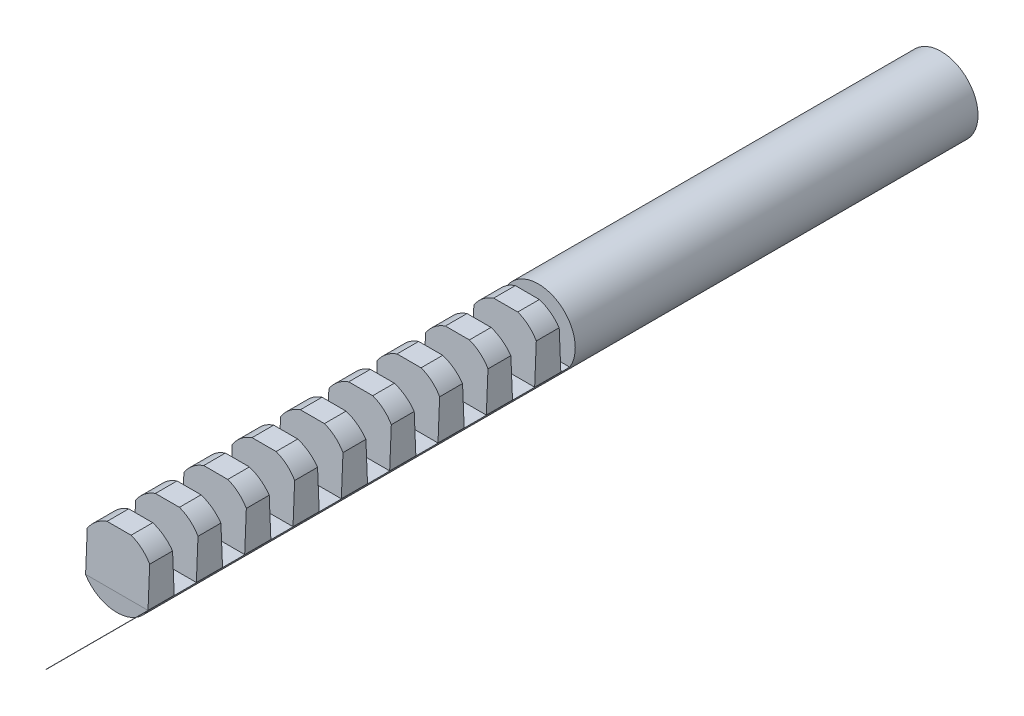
ISO-10303-21;
HEADER;
FILE_DESCRIPTION(('STEP AP214'),'2;1');
FILE_NAME('part.step','',(''),(''),'','','');
FILE_SCHEMA(('AUTOMOTIVE_DESIGN { 1 0 10303 214 1 1 1 1 }'));
ENDSEC;
DATA;
#1=APPLICATION_CONTEXT('core data for automotive mechanical design processes');
#2=APPLICATION_PROTOCOL_DEFINITION('international standard','automotive_design',2000,#1);
#3=PRODUCT_CONTEXT('',#1,'mechanical');
#4=PRODUCT('Part','Part','',(#3));
#5=PRODUCT_RELATED_PRODUCT_CATEGORY('part','',(#4));
#6=PRODUCT_DEFINITION_FORMATION('','',#4);
#7=PRODUCT_DEFINITION_CONTEXT('part definition',#1,'design');
#8=PRODUCT_DEFINITION('design','',#6,#7);
#9=PRODUCT_DEFINITION_SHAPE('','',#8);
#10=(LENGTH_UNIT() NAMED_UNIT(*) SI_UNIT(.MILLI.,.METRE.));
#11=(NAMED_UNIT(*) PLANE_ANGLE_UNIT() SI_UNIT($,.RADIAN.));
#12=(NAMED_UNIT(*) SI_UNIT($,.STERADIAN.) SOLID_ANGLE_UNIT());
#13=UNCERTAINTY_MEASURE_WITH_UNIT(LENGTH_MEASURE(1.E-05),#10,'distance_accuracy_value','');
#14=(GEOMETRIC_REPRESENTATION_CONTEXT(3) GLOBAL_UNCERTAINTY_ASSIGNED_CONTEXT((#13)) GLOBAL_UNIT_ASSIGNED_CONTEXT((#10,
#11,#12)) REPRESENTATION_CONTEXT('',''));
#15=CARTESIAN_POINT('',(0.,0.,0.));
#16=DIRECTION('',(0.,0.,1.));
#17=DIRECTION('',(1.,0.,0.));
#18=AXIS2_PLACEMENT_3D('',#15,#16,#17);
#19=CARTESIAN_POINT('',(-2.33666428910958,-1.45,59.));
#20=DIRECTION('',(0.,-1.,0.));
#21=DIRECTION('',(0.,0.,-1.));
#22=AXIS2_PLACEMENT_3D('',#19,#20,#21);
#23=PLANE('',#22);
#24=DIRECTION('',(0.,0.,-1.));
#25=VECTOR('',#24,1.);
#26=CARTESIAN_POINT('',(2.325,-1.45,20.65));
#27=LINE('',#26,#25);
#28=CARTESIAN_POINT('',(2.325,-1.45,22.6));
#29=VERTEX_POINT('',#28);
#30=CARTESIAN_POINT('',(2.325,-1.45,20.65));
#31=VERTEX_POINT('',#30);
#32=EDGE_CURVE('E770',#29,#31,#27,.T.);
#33=ORIENTED_EDGE('',*,*,#32,.F.);
#34=DIRECTION('',(-1.,0.,0.));
#35=VECTOR('',#34,1.);
#36=CARTESIAN_POINT('',(2.325,-1.45,22.6));
#37=LINE('',#36,#35);
#38=CARTESIAN_POINT('',(-2.325,-1.45,22.6));
#39=VERTEX_POINT('',#38);
#40=EDGE_CURVE('E484',#29,#39,#37,.T.);
#41=ORIENTED_EDGE('',*,*,#40,.T.);
#42=DIRECTION('',(0.,0.,-1.));
#43=VECTOR('',#42,1.);
#44=CARTESIAN_POINT('',(-2.325,-1.45,20.65));
#45=LINE('',#44,#43);
#46=CARTESIAN_POINT('',(-2.325,-1.45,20.65));
#47=VERTEX_POINT('',#46);
#48=EDGE_CURVE('E463',#39,#47,#45,.T.);
#49=ORIENTED_EDGE('',*,*,#48,.T.);
#50=DIRECTION('',(-1.,0.,0.));
#51=VECTOR('',#50,1.);
#52=CARTESIAN_POINT('',(2.325,-1.45,20.65));
#53=LINE('',#52,#51);
#54=EDGE_CURVE('E481',#31,#47,#53,.T.);
#55=ORIENTED_EDGE('',*,*,#54,.F.);
#56=EDGE_LOOP('',(#33,#41,#49,#55));
#57=FACE_BOUND('',#56,.T.);
#58=DIRECTION('',(0.,0.,-1.));
#59=VECTOR('',#58,1.);
#60=CARTESIAN_POINT('',(2.325,-1.45,27.85));
#61=LINE('',#60,#59);
#62=CARTESIAN_POINT('',(2.325,-1.45,29.8));
#63=VERTEX_POINT('',#62);
#64=CARTESIAN_POINT('',(2.325,-1.45,27.85));
#65=VERTEX_POINT('',#64);
#66=EDGE_CURVE('E514',#63,#65,#61,.T.);
#67=ORIENTED_EDGE('',*,*,#66,.F.);
#68=DIRECTION('',(-1.,0.,0.));
#69=VECTOR('',#68,1.);
#70=CARTESIAN_POINT('',(2.325,-1.45,29.8));
#71=LINE('',#70,#69);
#72=CARTESIAN_POINT('',(-2.325,-1.45,29.8));
#73=VERTEX_POINT('',#72);
#74=EDGE_CURVE('E533',#63,#73,#71,.T.);
#75=ORIENTED_EDGE('',*,*,#74,.T.);
#76=DIRECTION('',(0.,0.,-1.));
#77=VECTOR('',#76,1.);
#78=CARTESIAN_POINT('',(-2.325,-1.45,27.85));
#79=LINE('',#78,#77);
#80=CARTESIAN_POINT('',(-2.325,-1.45,27.85));
#81=VERTEX_POINT('',#80);
#82=EDGE_CURVE('E522',#73,#81,#79,.T.);
#83=ORIENTED_EDGE('',*,*,#82,.T.);
#84=DIRECTION('',(-1.,0.,0.));
#85=VECTOR('',#84,1.);
#86=CARTESIAN_POINT('',(2.325,-1.45,27.85));
#87=LINE('',#86,#85);
#88=EDGE_CURVE('E530',#65,#81,#87,.T.);
#89=ORIENTED_EDGE('',*,*,#88,.F.);
#90=EDGE_LOOP('',(#67,#75,#83,#89));
#91=FACE_BOUND('',#90,.T.);
#92=DIRECTION('',(0.,0.,-1.));
#93=VECTOR('',#92,1.);
#94=CARTESIAN_POINT('',(2.325,-1.45,35.05));
#95=LINE('',#94,#93);
#96=CARTESIAN_POINT('',(2.325,-1.45,37.));
#97=VERTEX_POINT('',#96);
#98=CARTESIAN_POINT('',(2.325,-1.45,35.05));
#99=VERTEX_POINT('',#98);
#100=EDGE_CURVE('E564',#97,#99,#95,.T.);
#101=ORIENTED_EDGE('',*,*,#100,.F.);
#102=DIRECTION('',(-1.,0.,0.));
#103=VECTOR('',#102,1.);
#104=CARTESIAN_POINT('',(2.325,-1.45,37.));
#105=LINE('',#104,#103);
#106=CARTESIAN_POINT('',(-2.325,-1.45,37.));
#107=VERTEX_POINT('',#106);
#108=EDGE_CURVE('E583',#97,#107,#105,.T.);
#109=ORIENTED_EDGE('',*,*,#108,.T.);
#110=DIRECTION('',(0.,0.,-1.));
#111=VECTOR('',#110,1.);
#112=CARTESIAN_POINT('',(-2.325,-1.45,35.05));
#113=LINE('',#112,#111);
#114=CARTESIAN_POINT('',(-2.325,-1.45,35.05));
#115=VERTEX_POINT('',#114);
#116=EDGE_CURVE('E572',#107,#115,#113,.T.);
#117=ORIENTED_EDGE('',*,*,#116,.T.);
#118=DIRECTION('',(-1.,0.,0.));
#119=VECTOR('',#118,1.);
#120=CARTESIAN_POINT('',(2.325,-1.45,35.05));
#121=LINE('',#120,#119);
#122=EDGE_CURVE('E580',#99,#115,#121,.T.);
#123=ORIENTED_EDGE('',*,*,#122,.F.);
#124=EDGE_LOOP('',(#101,#109,#117,#123));
#125=FACE_BOUND('',#124,.T.);
#126=DIRECTION('',(0.,0.,-1.));
#127=VECTOR('',#126,1.);
#128=CARTESIAN_POINT('',(2.325,-1.45,42.25));
#129=LINE('',#128,#127);
#130=CARTESIAN_POINT('',(2.325,-1.45,44.2));
#131=VERTEX_POINT('',#130);
#132=CARTESIAN_POINT('',(2.325,-1.45,42.25));
#133=VERTEX_POINT('',#132);
#134=EDGE_CURVE('E614',#131,#133,#129,.T.);
#135=ORIENTED_EDGE('',*,*,#134,.F.);
#136=DIRECTION('',(-1.,0.,0.));
#137=VECTOR('',#136,1.);
#138=CARTESIAN_POINT('',(2.325,-1.45,44.2));
#139=LINE('',#138,#137);
#140=CARTESIAN_POINT('',(-2.325,-1.45,44.2));
#141=VERTEX_POINT('',#140);
#142=EDGE_CURVE('E633',#131,#141,#139,.T.);
#143=ORIENTED_EDGE('',*,*,#142,.T.);
#144=DIRECTION('',(0.,0.,-1.));
#145=VECTOR('',#144,1.);
#146=CARTESIAN_POINT('',(-2.325,-1.45,42.25));
#147=LINE('',#146,#145);
#148=CARTESIAN_POINT('',(-2.325,-1.45,42.25));
#149=VERTEX_POINT('',#148);
#150=EDGE_CURVE('E622',#141,#149,#147,.T.);
#151=ORIENTED_EDGE('',*,*,#150,.T.);
#152=DIRECTION('',(-1.,0.,0.));
#153=VECTOR('',#152,1.);
#154=CARTESIAN_POINT('',(2.325,-1.45,42.25));
#155=LINE('',#154,#153);
#156=EDGE_CURVE('E630',#133,#149,#155,.T.);
#157=ORIENTED_EDGE('',*,*,#156,.F.);
#158=EDGE_LOOP('',(#135,#143,#151,#157));
#159=FACE_BOUND('',#158,.T.);
#160=DIRECTION('',(0.,0.,-1.));
#161=VECTOR('',#160,1.);
#162=CARTESIAN_POINT('',(-2.33666428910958,-1.45,59.));
#163=LINE('',#162,#161);
#164=CARTESIAN_POINT('',(-2.33666428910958,-1.45,51.4));
#165=VERTEX_POINT('',#164);
#166=CARTESIAN_POINT('',(-2.33666428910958,-1.45,20.));
#167=VERTEX_POINT('',#166);
#168=EDGE_CURVE('E422',#165,#167,#163,.T.);
#169=ORIENTED_EDGE('',*,*,#168,.F.);
#170=DIRECTION('',(1.,0.,0.));
#171=VECTOR('',#170,1.);
#172=CARTESIAN_POINT('',(-2.33666428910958,-1.45,51.4));
#173=LINE('',#172,#171);
#174=CARTESIAN_POINT('',(-2.325,-1.45,51.4));
#175=VERTEX_POINT('',#174);
#176=EDGE_CURVE('E406',#165,#175,#173,.T.);
#177=ORIENTED_EDGE('',*,*,#176,.T.);
#178=DIRECTION('',(0.,0.,-1.));
#179=VECTOR('',#178,1.);
#180=CARTESIAN_POINT('',(-2.325,-1.45,49.45));
#181=LINE('',#180,#179);
#182=CARTESIAN_POINT('',(-2.325,-1.45,49.45));
#183=VERTEX_POINT('',#182);
#184=EDGE_CURVE('E674',#175,#183,#181,.T.);
#185=ORIENTED_EDGE('',*,*,#184,.T.);
#186=DIRECTION('',(-1.,0.,0.));
#187=VECTOR('',#186,1.);
#188=CARTESIAN_POINT('',(2.325,-1.45,49.45));
#189=LINE('',#188,#187);
#190=CARTESIAN_POINT('',(2.325,-1.45,49.45));
#191=VERTEX_POINT('',#190);
#192=EDGE_CURVE('E682',#191,#183,#189,.T.);
#193=ORIENTED_EDGE('',*,*,#192,.F.);
#194=DIRECTION('',(0.,0.,-1.));
#195=VECTOR('',#194,1.);
#196=CARTESIAN_POINT('',(2.325,-1.45,49.45));
#197=LINE('',#196,#195);
#198=CARTESIAN_POINT('',(2.325,-1.45,51.4));
#199=VERTEX_POINT('',#198);
#200=EDGE_CURVE('E665',#199,#191,#197,.T.);
#201=ORIENTED_EDGE('',*,*,#200,.F.);
#202=DIRECTION('',(0.,0.,-1.));
#203=VECTOR('',#202,1.);
#204=CARTESIAN_POINT('',(2.325,-1.45,53.05));
#205=LINE('',#204,#203);
#206=CARTESIAN_POINT('',(2.325,-1.45,59.));
#207=VERTEX_POINT('',#206);
#208=EDGE_CURVE('E425',#207,#199,#205,.T.);
#209=ORIENTED_EDGE('',*,*,#208,.F.);
#210=DIRECTION('',(-1.,0.,0.));
#211=VECTOR('',#210,1.);
#212=CARTESIAN_POINT('',(-2.33666428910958,-1.45,59.));
#213=LINE('',#212,#211);
#214=CARTESIAN_POINT('',(2.33666428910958,-1.45,59.));
#215=VERTEX_POINT('',#214);
#216=EDGE_CURVE('E412',#215,#207,#213,.T.);
#217=ORIENTED_EDGE('',*,*,#216,.F.);
#218=DIRECTION('',(0.,0.,-1.));
#219=VECTOR('',#218,1.);
#220=CARTESIAN_POINT('',(2.33666428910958,-1.45,59.));
#221=LINE('',#220,#219);
#222=CARTESIAN_POINT('',(2.33666428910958,-1.45,20.));
#223=VERTEX_POINT('',#222);
#224=EDGE_CURVE('E419',#215,#223,#221,.T.);
#225=ORIENTED_EDGE('',*,*,#224,.T.);
#226=DIRECTION('',(-1.,0.,0.));
#227=VECTOR('',#226,1.);
#228=CARTESIAN_POINT('',(-2.33666428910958,-1.45,20.));
#229=LINE('',#228,#227);
#230=EDGE_CURVE('E420',#223,#167,#229,.T.);
#231=ORIENTED_EDGE('',*,*,#230,.T.);
#232=EDGE_LOOP('',(#169,#177,#185,#193,#201,#209,#217,#225,#231));
#233=FACE_BOUND('',#232,.T.);
#234=DIRECTION('',(0.,0.,-1.));
#235=VECTOR('',#234,1.);
#236=CARTESIAN_POINT('',(2.325,-1.45,45.85));
#237=LINE('',#236,#235);
#238=CARTESIAN_POINT('',(2.325,-1.45,47.8));
#239=VERTEX_POINT('',#238);
#240=CARTESIAN_POINT('',(2.325,-1.45,45.85));
#241=VERTEX_POINT('',#240);
#242=EDGE_CURVE('E639',#239,#241,#237,.T.);
#243=ORIENTED_EDGE('',*,*,#242,.F.);
#244=DIRECTION('',(-1.,0.,0.));
#245=VECTOR('',#244,1.);
#246=CARTESIAN_POINT('',(2.325,-1.45,47.8));
#247=LINE('',#246,#245);
#248=CARTESIAN_POINT('',(-2.325,-1.45,47.8));
#249=VERTEX_POINT('',#248);
#250=EDGE_CURVE('E658',#239,#249,#247,.T.);
#251=ORIENTED_EDGE('',*,*,#250,.T.);
#252=DIRECTION('',(0.,0.,-1.));
#253=VECTOR('',#252,1.);
#254=CARTESIAN_POINT('',(-2.325,-1.45,45.85));
#255=LINE('',#254,#253);
#256=CARTESIAN_POINT('',(-2.325,-1.45,45.85));
#257=VERTEX_POINT('',#256);
#258=EDGE_CURVE('E647',#249,#257,#255,.T.);
#259=ORIENTED_EDGE('',*,*,#258,.T.);
#260=DIRECTION('',(-1.,0.,0.));
#261=VECTOR('',#260,1.);
#262=CARTESIAN_POINT('',(2.325,-1.45,45.85));
#263=LINE('',#262,#261);
#264=EDGE_CURVE('E655',#241,#257,#263,.T.);
#265=ORIENTED_EDGE('',*,*,#264,.F.);
#266=EDGE_LOOP('',(#243,#251,#259,#265));
#267=FACE_BOUND('',#266,.T.);
#268=DIRECTION('',(0.,0.,-1.));
#269=VECTOR('',#268,1.);
#270=CARTESIAN_POINT('',(2.325,-1.45,38.65));
#271=LINE('',#270,#269);
#272=CARTESIAN_POINT('',(2.325,-1.45,40.6));
#273=VERTEX_POINT('',#272);
#274=CARTESIAN_POINT('',(2.325,-1.45,38.65));
#275=VERTEX_POINT('',#274);
#276=EDGE_CURVE('E589',#273,#275,#271,.T.);
#277=ORIENTED_EDGE('',*,*,#276,.F.);
#278=DIRECTION('',(-1.,0.,0.));
#279=VECTOR('',#278,1.);
#280=CARTESIAN_POINT('',(2.325,-1.45,40.6));
#281=LINE('',#280,#279);
#282=CARTESIAN_POINT('',(-2.325,-1.45,40.6));
#283=VERTEX_POINT('',#282);
#284=EDGE_CURVE('E608',#273,#283,#281,.T.);
#285=ORIENTED_EDGE('',*,*,#284,.T.);
#286=DIRECTION('',(0.,0.,-1.));
#287=VECTOR('',#286,1.);
#288=CARTESIAN_POINT('',(-2.325,-1.45,38.65));
#289=LINE('',#288,#287);
#290=CARTESIAN_POINT('',(-2.325,-1.45,38.65));
#291=VERTEX_POINT('',#290);
#292=EDGE_CURVE('E597',#283,#291,#289,.T.);
#293=ORIENTED_EDGE('',*,*,#292,.T.);
#294=DIRECTION('',(-1.,0.,0.));
#295=VECTOR('',#294,1.);
#296=CARTESIAN_POINT('',(2.325,-1.45,38.65));
#297=LINE('',#296,#295);
#298=EDGE_CURVE('E605',#275,#291,#297,.T.);
#299=ORIENTED_EDGE('',*,*,#298,.F.);
#300=EDGE_LOOP('',(#277,#285,#293,#299));
#301=FACE_BOUND('',#300,.T.);
#302=DIRECTION('',(0.,0.,-1.));
#303=VECTOR('',#302,1.);
#304=CARTESIAN_POINT('',(2.325,-1.45,31.45));
#305=LINE('',#304,#303);
#306=CARTESIAN_POINT('',(2.325,-1.45,33.4));
#307=VERTEX_POINT('',#306);
#308=CARTESIAN_POINT('',(2.325,-1.45,31.45));
#309=VERTEX_POINT('',#308);
#310=EDGE_CURVE('E539',#307,#309,#305,.T.);
#311=ORIENTED_EDGE('',*,*,#310,.F.);
#312=DIRECTION('',(-1.,0.,0.));
#313=VECTOR('',#312,1.);
#314=CARTESIAN_POINT('',(2.325,-1.45,33.4));
#315=LINE('',#314,#313);
#316=CARTESIAN_POINT('',(-2.325,-1.45,33.4));
#317=VERTEX_POINT('',#316);
#318=EDGE_CURVE('E558',#307,#317,#315,.T.);
#319=ORIENTED_EDGE('',*,*,#318,.T.);
#320=DIRECTION('',(0.,0.,-1.));
#321=VECTOR('',#320,1.);
#322=CARTESIAN_POINT('',(-2.325,-1.45,31.45));
#323=LINE('',#322,#321);
#324=CARTESIAN_POINT('',(-2.325,-1.45,31.45));
#325=VERTEX_POINT('',#324);
#326=EDGE_CURVE('E547',#317,#325,#323,.T.);
#327=ORIENTED_EDGE('',*,*,#326,.T.);
#328=DIRECTION('',(-1.,0.,0.));
#329=VECTOR('',#328,1.);
#330=CARTESIAN_POINT('',(2.325,-1.45,31.45));
#331=LINE('',#330,#329);
#332=EDGE_CURVE('E555',#309,#325,#331,.T.);
#333=ORIENTED_EDGE('',*,*,#332,.F.);
#334=EDGE_LOOP('',(#311,#319,#327,#333));
#335=FACE_BOUND('',#334,.T.);
#336=DIRECTION('',(0.,0.,-1.));
#337=VECTOR('',#336,1.);
#338=CARTESIAN_POINT('',(2.325,-1.45,24.25));
#339=LINE('',#338,#337);
#340=CARTESIAN_POINT('',(2.325,-1.45,26.2));
#341=VERTEX_POINT('',#340);
#342=CARTESIAN_POINT('',(2.325,-1.45,24.25));
#343=VERTEX_POINT('',#342);
#344=EDGE_CURVE('E489',#341,#343,#339,.T.);
#345=ORIENTED_EDGE('',*,*,#344,.F.);
#346=DIRECTION('',(-1.,0.,0.));
#347=VECTOR('',#346,1.);
#348=CARTESIAN_POINT('',(2.325,-1.45,26.2));
#349=LINE('',#348,#347);
#350=CARTESIAN_POINT('',(-2.325,-1.45,26.2));
#351=VERTEX_POINT('',#350);
#352=EDGE_CURVE('E508',#341,#351,#349,.T.);
#353=ORIENTED_EDGE('',*,*,#352,.T.);
#354=DIRECTION('',(0.,0.,-1.));
#355=VECTOR('',#354,1.);
#356=CARTESIAN_POINT('',(-2.325,-1.45,24.25));
#357=LINE('',#356,#355);
#358=CARTESIAN_POINT('',(-2.325,-1.45,24.25));
#359=VERTEX_POINT('',#358);
#360=EDGE_CURVE('E497',#351,#359,#357,.T.);
#361=ORIENTED_EDGE('',*,*,#360,.T.);
#362=DIRECTION('',(-1.,0.,0.));
#363=VECTOR('',#362,1.);
#364=CARTESIAN_POINT('',(2.325,-1.45,24.25));
#365=LINE('',#364,#363);
#366=EDGE_CURVE('E505',#343,#359,#365,.T.);
#367=ORIENTED_EDGE('',*,*,#366,.F.);
#368=EDGE_LOOP('',(#345,#353,#361,#367));
#369=FACE_BOUND('',#368,.T.);
#370=ADVANCED_FACE('F33',(#57,#91,#125,#159,#233,#267,#301,#335,#369),#23,.F.);
#371=CARTESIAN_POINT('',(0.,0.,-10.));
#372=DIRECTION('',(0.,0.,1.));
#373=DIRECTION('',(1.,0.,0.));
#374=AXIS2_PLACEMENT_3D('',#371,#372,#373);
#375=CYLINDRICAL_SURFACE('',#374,2.75);
#376=CARTESIAN_POINT('',(0.,0.,51.4));
#377=DIRECTION('',(0.,0.,-1.));
#378=DIRECTION('',(-1.,0.,0.));
#379=AXIS2_PLACEMENT_3D('',#376,#377,#378);
#380=CIRCLE('',#379,2.75);
#381=CARTESIAN_POINT('',(2.325,-1.46863031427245,51.4));
#382=VERTEX_POINT('',#381);
#383=EDGE_CURVE('E691',#165,#382,#380,.F.);
#384=ORIENTED_EDGE('',*,*,#383,.F.);
#385=ORIENTED_EDGE('',*,*,#168,.T.);
#386=CARTESIAN_POINT('',(0.,0.,20.));
#387=DIRECTION('',(0.,0.,1.));
#388=DIRECTION('',(1.,0.,0.));
#389=AXIS2_PLACEMENT_3D('',#386,#387,#388);
#390=CIRCLE('',#389,2.75);
#391=EDGE_CURVE('E432',#223,#167,#390,.T.);
#392=ORIENTED_EDGE('',*,*,#391,.F.);
#393=ORIENTED_EDGE('',*,*,#224,.F.);
#394=CARTESIAN_POINT('',(0.,0.,59.));
#395=DIRECTION('',(0.,0.,1.));
#396=DIRECTION('',(1.,0.,0.));
#397=AXIS2_PLACEMENT_3D('',#394,#395,#396);
#398=CIRCLE('',#397,2.75);
#399=CARTESIAN_POINT('',(2.325,-1.46863031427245,59.));
#400=VERTEX_POINT('',#399);
#401=EDGE_CURVE('E410',#400,#215,#398,.T.);
#402=ORIENTED_EDGE('',*,*,#401,.F.);
#403=DIRECTION('',(0.,0.,1.));
#404=VECTOR('',#403,1.);
#405=CARTESIAN_POINT('',(2.325,-1.46863031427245,-10.));
#406=LINE('',#405,#404);
#407=EDGE_CURVE('E396',#382,#400,#406,.T.);
#408=ORIENTED_EDGE('',*,*,#407,.F.);
#409=EDGE_LOOP('',(#384,#385,#392,#393,#402,#408));
#410=FACE_BOUND('',#409,.T.);
#411=CARTESIAN_POINT('',(0.,0.,-10.));
#412=DIRECTION('',(0.,0.,1.));
#413=DIRECTION('',(1.,0.,0.));
#414=AXIS2_PLACEMENT_3D('',#411,#412,#413);
#415=CIRCLE('',#414,2.75);
#416=CARTESIAN_POINT('',(2.75,0.,-10.));
#417=VERTEX_POINT('',#416);
#418=EDGE_CURVE('E435',#417,#417,#415,.T.);
#419=ORIENTED_EDGE('',*,*,#418,.T.);
#420=EDGE_LOOP('',(#419));
#421=FACE_BOUND('',#420,.T.);
#422=ADVANCED_FACE('F35',(#410,#421),#375,.T.);
#423=CARTESIAN_POINT('',(0.,0.,-10.));
#424=DIRECTION('',(0.,0.,1.));
#425=DIRECTION('',(1.,0.,0.));
#426=AXIS2_PLACEMENT_3D('',#423,#424,#425);
#427=PLANE('',#426);
#428=CARTESIAN_POINT('',(0.,0.,-10.));
#429=DIRECTION('',(0.,0.,-1.));
#430=DIRECTION('',(-1.,0.,0.));
#431=AXIS2_PLACEMENT_3D('',#428,#429,#430);
#432=CIRCLE('',#431,1.5);
#433=CARTESIAN_POINT('',(-1.5,0.,-10.));
#434=VERTEX_POINT('',#433);
#435=EDGE_CURVE('E898',#434,#434,#432,.T.);
#436=ORIENTED_EDGE('',*,*,#435,.F.);
#437=EDGE_LOOP('',(#436));
#438=FACE_BOUND('',#437,.T.);
#439=ORIENTED_EDGE('',*,*,#418,.F.);
#440=EDGE_LOOP('',(#439));
#441=FACE_BOUND('',#440,.T.);
#442=ADVANCED_FACE('F912',(#438,#441),#427,.F.);
#443=CARTESIAN_POINT('',(0.,0.,20.));
#444=DIRECTION('',(0.,0.,1.));
#445=DIRECTION('',(1.,0.,0.));
#446=AXIS2_PLACEMENT_3D('',#443,#444,#445);
#447=PLANE('',#446);
#448=ORIENTED_EDGE('',*,*,#230,.F.);
#449=ORIENTED_EDGE('',*,*,#391,.T.);
#450=EDGE_LOOP('',(#448,#449));
#451=FACE_BOUND('',#450,.T.);
#452=ADVANCED_FACE('F915',(#451),#447,.T.);
#453=CARTESIAN_POINT('',(0.,0.,59.));
#454=DIRECTION('',(0.,0.,1.));
#455=DIRECTION('',(1.,0.,0.));
#456=AXIS2_PLACEMENT_3D('',#453,#454,#455);
#457=PLANE('',#456);
#458=DIRECTION('',(0.,1.,0.));
#459=VECTOR('',#458,1.);
#460=CARTESIAN_POINT('',(2.325,-7.4,59.));
#461=LINE('',#460,#459);
#462=EDGE_CURVE('E399',#400,#207,#461,.T.);
#463=ORIENTED_EDGE('',*,*,#462,.F.);
#464=ORIENTED_EDGE('',*,*,#401,.T.);
#465=ORIENTED_EDGE('',*,*,#216,.T.);
#466=EDGE_LOOP('',(#463,#464,#465));
#467=FACE_BOUND('',#466,.T.);
#468=ADVANCED_FACE('F409',(#467),#457,.T.);
#469=CARTESIAN_POINT('',(2.325,2.6,51.23125));
#470=DIRECTION('',(0.,-0.0416305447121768,-0.999133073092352));
#471=DIRECTION('',(0.,0.999133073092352,-0.0416305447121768));
#472=AXIS2_PLACEMENT_3D('',#469,#470,#471);
#473=PLANE('',#472);
#474=DIRECTION('',(0.,-0.999133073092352,0.0416305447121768));
#475=VECTOR('',#474,1.);
#476=CARTESIAN_POINT('',(2.325,2.6,51.23125));
#477=LINE('',#476,#475);
#478=CARTESIAN_POINT('',(2.325,1.46863031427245,51.278390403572));
#479=VERTEX_POINT('',#478);
#480=EDGE_CURVE('E662',#479,#199,#477,.T.);
#481=ORIENTED_EDGE('',*,*,#480,.F.);
#482=CARTESIAN_POINT('',(0.,0.,51.3395833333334));
#483=DIRECTION('',(0.,-0.0416305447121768,-0.999133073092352));
#484=DIRECTION('',(0.,-0.999133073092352,0.0416305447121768));
#485=AXIS2_PLACEMENT_3D('',#482,#483,#484);
#486=ELLIPSE('',#485,2.75238611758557,2.75);
#487=CARTESIAN_POINT('',(0.895823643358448,2.6,51.23125));
#488=VERTEX_POINT('',#487);
#489=EDGE_CURVE('E48',#479,#488,#486,.F.);
#490=ORIENTED_EDGE('',*,*,#489,.T.);
#491=DIRECTION('',(-1.,0.,0.));
#492=VECTOR('',#491,1.);
#493=CARTESIAN_POINT('',(2.325,2.6,51.23125));
#494=LINE('',#493,#492);
#495=CARTESIAN_POINT('',(-0.895823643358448,2.6,51.23125));
#496=VERTEX_POINT('',#495);
#497=EDGE_CURVE('E671',#488,#496,#494,.T.);
#498=ORIENTED_EDGE('',*,*,#497,.T.);
#499=CARTESIAN_POINT('',(0.,0.,51.3395833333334));
#500=DIRECTION('',(0.,-0.0416305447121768,-0.999133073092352));
#501=DIRECTION('',(0.,-0.999133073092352,0.0416305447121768));
#502=AXIS2_PLACEMENT_3D('',#499,#500,#501);
#503=ELLIPSE('',#502,2.75238611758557,2.75);
#504=CARTESIAN_POINT('',(-2.325,1.46863031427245,51.278390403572));
#505=VERTEX_POINT('',#504);
#506=EDGE_CURVE('E465',#496,#505,#503,.F.);
#507=ORIENTED_EDGE('',*,*,#506,.T.);
#508=DIRECTION('',(0.,-0.999133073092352,0.0416305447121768));
#509=VECTOR('',#508,1.);
#510=CARTESIAN_POINT('',(-2.325,2.6,51.23125));
#511=LINE('',#510,#509);
#512=EDGE_CURVE('E661',#505,#175,#511,.T.);
#513=ORIENTED_EDGE('',*,*,#512,.T.);
#514=DIRECTION('',(-1.,0.,0.));
#515=VECTOR('',#514,1.);
#516=CARTESIAN_POINT('',(2.325,-1.45,51.4));
#517=LINE('',#516,#515);
#518=EDGE_CURVE('E684',#199,#175,#517,.T.);
#519=ORIENTED_EDGE('',*,*,#518,.F.);
#520=EDGE_LOOP('',(#481,#490,#498,#507,#513,#519));
#521=FACE_BOUND('',#520,.T.);
#522=ADVANCED_FACE('F699',(#521),#473,.F.);
#523=CARTESIAN_POINT('',(2.325,2.6,49.61875));
#524=DIRECTION('',(0.,-0.0416305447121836,0.999133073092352));
#525=DIRECTION('',(0.,-0.999133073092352,-0.0416305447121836));
#526=AXIS2_PLACEMENT_3D('',#523,#524,#525);
#527=PLANE('',#526);
#528=DIRECTION('',(-1.,0.,0.));
#529=VECTOR('',#528,1.);
#530=CARTESIAN_POINT('',(2.325,2.6,49.61875));
#531=LINE('',#530,#529);
#532=CARTESIAN_POINT('',(0.895823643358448,2.6,49.61875));
#533=VERTEX_POINT('',#532);
#534=CARTESIAN_POINT('',(-0.895823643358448,2.6,49.61875));
#535=VERTEX_POINT('',#534);
#536=EDGE_CURVE('E680',#533,#535,#531,.T.);
#537=ORIENTED_EDGE('',*,*,#536,.F.);
#538=CARTESIAN_POINT('',(0.,0.,49.5104166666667));
#539=DIRECTION('',(0.,-0.0416305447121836,0.999133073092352));
#540=DIRECTION('',(0.,0.999133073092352,0.0416305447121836));
#541=AXIS2_PLACEMENT_3D('',#538,#539,#540);
#542=ELLIPSE('',#541,2.75238611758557,2.75);
#543=CARTESIAN_POINT('',(2.325,1.46863031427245,49.571609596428));
#544=VERTEX_POINT('',#543);
#545=EDGE_CURVE('E710',#533,#544,#542,.F.);
#546=ORIENTED_EDGE('',*,*,#545,.T.);
#547=DIRECTION('',(0.,0.999133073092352,0.0416305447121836));
#548=VECTOR('',#547,1.);
#549=CARTESIAN_POINT('',(2.325,2.6,49.61875));
#550=LINE('',#549,#548);
#551=EDGE_CURVE('E668',#191,#544,#550,.T.);
#552=ORIENTED_EDGE('',*,*,#551,.F.);
#553=ORIENTED_EDGE('',*,*,#192,.T.);
#554=DIRECTION('',(0.,0.999133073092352,0.0416305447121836));
#555=VECTOR('',#554,1.);
#556=CARTESIAN_POINT('',(-2.325,2.6,49.61875));
#557=LINE('',#556,#555);
#558=CARTESIAN_POINT('',(-2.325,1.46863031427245,49.571609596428));
#559=VERTEX_POINT('',#558);
#560=EDGE_CURVE('E666',#183,#559,#557,.T.);
#561=ORIENTED_EDGE('',*,*,#560,.T.);
#562=CARTESIAN_POINT('',(0.,0.,49.5104166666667));
#563=DIRECTION('',(0.,-0.0416305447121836,0.999133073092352));
#564=DIRECTION('',(0.,0.999133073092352,0.0416305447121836));
#565=AXIS2_PLACEMENT_3D('',#562,#563,#564);
#566=ELLIPSE('',#565,2.75238611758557,2.75);
#567=EDGE_CURVE('E470',#559,#535,#566,.F.);
#568=ORIENTED_EDGE('',*,*,#567,.T.);
#569=EDGE_LOOP('',(#537,#546,#552,#553,#561,#568));
#570=FACE_BOUND('',#569,.T.);
#571=ADVANCED_FACE('F707',(#570),#527,.F.);
#572=CARTESIAN_POINT('',(2.325,2.6,49.61875));
#573=DIRECTION('',(0.,-1.,0.));
#574=DIRECTION('',(0.,0.,-1.));
#575=AXIS2_PLACEMENT_3D('',#572,#573,#574);
#576=PLANE('',#575);
#577=ORIENTED_EDGE('',*,*,#497,.F.);
#578=DIRECTION('',(0.,0.,1.));
#579=VECTOR('',#578,1.);
#580=CARTESIAN_POINT('',(0.895823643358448,2.6,-10.));
#581=LINE('',#580,#579);
#582=EDGE_CURVE('E886',#533,#488,#581,.T.);
#583=ORIENTED_EDGE('',*,*,#582,.F.);
#584=ORIENTED_EDGE('',*,*,#536,.T.);
#585=DIRECTION('',(0.,0.,1.));
#586=VECTOR('',#585,1.);
#587=CARTESIAN_POINT('',(-0.895823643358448,2.6,-10.));
#588=LINE('',#587,#586);
#589=EDGE_CURVE('E713',#535,#496,#588,.T.);
#590=ORIENTED_EDGE('',*,*,#589,.T.);
#591=EDGE_LOOP('',(#577,#583,#584,#590));
#592=FACE_BOUND('',#591,.T.);
#593=ADVANCED_FACE('F938',(#592),#576,.F.);
#594=CARTESIAN_POINT('',(2.325,0.,-3.6));
#595=DIRECTION('',(-1.,0.,0.));
#596=DIRECTION('',(0.,0.,1.));
#597=AXIS2_PLACEMENT_3D('',#594,#595,#596);
#598=PLANE('',#597);
#599=ORIENTED_EDGE('',*,*,#551,.T.);
#600=DIRECTION('',(0.,0.,1.));
#601=VECTOR('',#600,1.);
#602=CARTESIAN_POINT('',(2.325,1.46863031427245,-10.));
#603=LINE('',#602,#601);
#604=EDGE_CURVE('E697',#544,#479,#603,.T.);
#605=ORIENTED_EDGE('',*,*,#604,.T.);
#606=ORIENTED_EDGE('',*,*,#480,.T.);
#607=ORIENTED_EDGE('',*,*,#200,.T.);
#608=EDGE_LOOP('',(#599,#605,#606,#607));
#609=FACE_BOUND('',#608,.T.);
#610=ADVANCED_FACE('F695',(#609),#598,.F.);
#611=CARTESIAN_POINT('',(-2.325,0.,-3.6));
#612=DIRECTION('',(-1.,0.,0.));
#613=DIRECTION('',(0.,0.,1.));
#614=AXIS2_PLACEMENT_3D('',#611,#612,#613);
#615=PLANE('',#614);
#616=DIRECTION('',(0.,0.,1.));
#617=VECTOR('',#616,1.);
#618=CARTESIAN_POINT('',(-2.325,1.46863031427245,-10.));
#619=LINE('',#618,#617);
#620=EDGE_CURVE('E719',#559,#505,#619,.T.);
#621=ORIENTED_EDGE('',*,*,#620,.F.);
#622=ORIENTED_EDGE('',*,*,#560,.F.);
#623=ORIENTED_EDGE('',*,*,#184,.F.);
#624=ORIENTED_EDGE('',*,*,#512,.F.);
#625=EDGE_LOOP('',(#621,#622,#623,#624));
#626=FACE_BOUND('',#625,.T.);
#627=ADVANCED_FACE('F944',(#626),#615,.T.);
#628=CARTESIAN_POINT('',(2.325,2.6,47.63125));
#629=DIRECTION('',(0.,-0.0416305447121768,-0.999133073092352));
#630=DIRECTION('',(0.,0.999133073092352,-0.0416305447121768));
#631=AXIS2_PLACEMENT_3D('',#628,#629,#630);
#632=PLANE('',#631);
#633=DIRECTION('',(0.,-0.999133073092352,0.0416305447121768));
#634=VECTOR('',#633,1.);
#635=CARTESIAN_POINT('',(2.325,2.6,47.63125));
#636=LINE('',#635,#634);
#637=CARTESIAN_POINT('',(2.325,1.46863031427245,47.678390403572));
#638=VERTEX_POINT('',#637);
#639=EDGE_CURVE('E637',#638,#239,#636,.T.);
#640=ORIENTED_EDGE('',*,*,#639,.F.);
#641=CARTESIAN_POINT('',(0.,0.,47.7395833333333));
#642=DIRECTION('',(0.,-0.0416305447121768,-0.999133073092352));
#643=DIRECTION('',(0.,-0.999133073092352,0.0416305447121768));
#644=AXIS2_PLACEMENT_3D('',#641,#642,#643);
#645=ELLIPSE('',#644,2.75238611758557,2.75);
#646=CARTESIAN_POINT('',(0.895823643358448,2.6,47.63125));
#647=VERTEX_POINT('',#646);
#648=EDGE_CURVE('E56',#638,#647,#645,.F.);
#649=ORIENTED_EDGE('',*,*,#648,.T.);
#650=DIRECTION('',(-1.,0.,0.));
#651=VECTOR('',#650,1.);
#652=CARTESIAN_POINT('',(2.325,2.6,47.63125));
#653=LINE('',#652,#651);
#654=CARTESIAN_POINT('',(-0.895823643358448,2.6,47.63125));
#655=VERTEX_POINT('',#654);
#656=EDGE_CURVE('E645',#647,#655,#653,.T.);
#657=ORIENTED_EDGE('',*,*,#656,.T.);
#658=CARTESIAN_POINT('',(0.,0.,47.7395833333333));
#659=DIRECTION('',(0.,-0.0416305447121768,-0.999133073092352));
#660=DIRECTION('',(0.,-0.999133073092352,0.0416305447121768));
#661=AXIS2_PLACEMENT_3D('',#658,#659,#660);
#662=ELLIPSE('',#661,2.75238611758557,2.75);
#663=CARTESIAN_POINT('',(-2.325,1.46863031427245,47.678390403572));
#664=VERTEX_POINT('',#663);
#665=EDGE_CURVE('E766',#655,#664,#662,.F.);
#666=ORIENTED_EDGE('',*,*,#665,.T.);
#667=DIRECTION('',(0.,-0.999133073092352,0.0416305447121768));
#668=VECTOR('',#667,1.);
#669=CARTESIAN_POINT('',(-2.325,2.6,47.63125));
#670=LINE('',#669,#668);
#671=EDGE_CURVE('E636',#664,#249,#670,.T.);
#672=ORIENTED_EDGE('',*,*,#671,.T.);
#673=ORIENTED_EDGE('',*,*,#250,.F.);
#674=EDGE_LOOP('',(#640,#649,#657,#666,#672,#673));
#675=FACE_BOUND('',#674,.T.);
#676=ADVANCED_FACE('F947',(#675),#632,.F.);
#677=CARTESIAN_POINT('',(2.325,2.6,46.01875));
#678=DIRECTION('',(0.,-0.0416305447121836,0.999133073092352));
#679=DIRECTION('',(0.,-0.999133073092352,-0.0416305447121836));
#680=AXIS2_PLACEMENT_3D('',#677,#678,#679);
#681=PLANE('',#680);
#682=DIRECTION('',(-1.,0.,0.));
#683=VECTOR('',#682,1.);
#684=CARTESIAN_POINT('',(2.325,2.6,46.01875));
#685=LINE('',#684,#683);
#686=CARTESIAN_POINT('',(0.895823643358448,2.6,46.01875));
#687=VERTEX_POINT('',#686);
#688=CARTESIAN_POINT('',(-0.895823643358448,2.6,46.01875));
#689=VERTEX_POINT('',#688);
#690=EDGE_CURVE('E653',#687,#689,#685,.T.);
#691=ORIENTED_EDGE('',*,*,#690,.F.);
#692=CARTESIAN_POINT('',(0.,0.,45.9104166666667));
#693=DIRECTION('',(0.,-0.0416305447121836,0.999133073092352));
#694=DIRECTION('',(0.,0.999133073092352,0.0416305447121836));
#695=AXIS2_PLACEMENT_3D('',#692,#693,#694);
#696=ELLIPSE('',#695,2.75238611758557,2.75);
#697=CARTESIAN_POINT('',(2.325,1.46863031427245,45.971609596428));
#698=VERTEX_POINT('',#697);
#699=EDGE_CURVE('E715',#687,#698,#696,.F.);
#700=ORIENTED_EDGE('',*,*,#699,.T.);
#701=DIRECTION('',(0.,0.999133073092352,0.0416305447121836));
#702=VECTOR('',#701,1.);
#703=CARTESIAN_POINT('',(2.325,2.6,46.01875));
#704=LINE('',#703,#702);
#705=EDGE_CURVE('E642',#241,#698,#704,.T.);
#706=ORIENTED_EDGE('',*,*,#705,.F.);
#707=ORIENTED_EDGE('',*,*,#264,.T.);
#708=DIRECTION('',(0.,0.999133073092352,0.0416305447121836));
#709=VECTOR('',#708,1.);
#710=CARTESIAN_POINT('',(-2.325,2.6,46.01875));
#711=LINE('',#710,#709);
#712=CARTESIAN_POINT('',(-2.325,1.46863031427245,45.971609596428));
#713=VERTEX_POINT('',#712);
#714=EDGE_CURVE('E640',#257,#713,#711,.T.);
#715=ORIENTED_EDGE('',*,*,#714,.T.);
#716=CARTESIAN_POINT('',(0.,0.,45.9104166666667));
#717=DIRECTION('',(0.,-0.0416305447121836,0.999133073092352));
#718=DIRECTION('',(0.,0.999133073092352,0.0416305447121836));
#719=AXIS2_PLACEMENT_3D('',#716,#717,#718);
#720=ELLIPSE('',#719,2.75238611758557,2.75);
#721=EDGE_CURVE('E763',#713,#689,#720,.F.);
#722=ORIENTED_EDGE('',*,*,#721,.T.);
#723=EDGE_LOOP('',(#691,#700,#706,#707,#715,#722));
#724=FACE_BOUND('',#723,.T.);
#725=ADVANCED_FACE('F834',(#724),#681,.F.);
#726=CARTESIAN_POINT('',(2.325,2.6,46.01875));
#727=DIRECTION('',(0.,-1.,0.));
#728=DIRECTION('',(0.,0.,-1.));
#729=AXIS2_PLACEMENT_3D('',#726,#727,#728);
#730=PLANE('',#729);
#731=ORIENTED_EDGE('',*,*,#656,.F.);
#732=EDGE_CURVE('E889',#687,#647,#581,.T.);
#733=ORIENTED_EDGE('',*,*,#732,.F.);
#734=ORIENTED_EDGE('',*,*,#690,.T.);
#735=EDGE_CURVE('E726',#689,#655,#588,.T.);
#736=ORIENTED_EDGE('',*,*,#735,.T.);
#737=EDGE_LOOP('',(#731,#733,#734,#736));
#738=FACE_BOUND('',#737,.T.);
#739=ADVANCED_FACE('F826',(#738),#730,.F.);
#740=CARTESIAN_POINT('',(2.325,0.,-7.2));
#741=DIRECTION('',(-1.,0.,0.));
#742=DIRECTION('',(0.,0.,1.));
#743=AXIS2_PLACEMENT_3D('',#740,#741,#742);
#744=PLANE('',#743);
#745=ORIENTED_EDGE('',*,*,#705,.T.);
#746=EDGE_CURVE('E894',#698,#638,#603,.T.);
#747=ORIENTED_EDGE('',*,*,#746,.T.);
#748=ORIENTED_EDGE('',*,*,#639,.T.);
#749=ORIENTED_EDGE('',*,*,#242,.T.);
#750=EDGE_LOOP('',(#745,#747,#748,#749));
#751=FACE_BOUND('',#750,.T.);
#752=ADVANCED_FACE('F958',(#751),#744,.F.);
#753=CARTESIAN_POINT('',(-2.325,0.,-7.2));
#754=DIRECTION('',(-1.,0.,0.));
#755=DIRECTION('',(0.,0.,1.));
#756=AXIS2_PLACEMENT_3D('',#753,#754,#755);
#757=PLANE('',#756);
#758=EDGE_CURVE('E721',#713,#664,#619,.T.);
#759=ORIENTED_EDGE('',*,*,#758,.F.);
#760=ORIENTED_EDGE('',*,*,#714,.F.);
#761=ORIENTED_EDGE('',*,*,#258,.F.);
#762=ORIENTED_EDGE('',*,*,#671,.F.);
#763=EDGE_LOOP('',(#759,#760,#761,#762));
#764=FACE_BOUND('',#763,.T.);
#765=ADVANCED_FACE('F840',(#764),#757,.T.);
#766=CARTESIAN_POINT('',(2.325,2.6,44.03125));
#767=DIRECTION('',(0.,-0.0416305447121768,-0.999133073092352));
#768=DIRECTION('',(0.,0.999133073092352,-0.0416305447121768));
#769=AXIS2_PLACEMENT_3D('',#766,#767,#768);
#770=PLANE('',#769);
#771=DIRECTION('',(0.,-0.999133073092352,0.0416305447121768));
#772=VECTOR('',#771,1.);
#773=CARTESIAN_POINT('',(2.325,2.6,44.03125));
#774=LINE('',#773,#772);
#775=CARTESIAN_POINT('',(2.325,1.46863031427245,44.078390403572));
#776=VERTEX_POINT('',#775);
#777=EDGE_CURVE('E612',#776,#131,#774,.T.);
#778=ORIENTED_EDGE('',*,*,#777,.F.);
#779=CARTESIAN_POINT('',(0.,0.,44.1395833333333));
#780=DIRECTION('',(0.,-0.0416305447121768,-0.999133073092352));
#781=DIRECTION('',(0.,-0.999133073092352,0.0416305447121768));
#782=AXIS2_PLACEMENT_3D('',#779,#780,#781);
#783=ELLIPSE('',#782,2.75238611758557,2.75);
#784=CARTESIAN_POINT('',(0.895823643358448,2.6,44.03125));
#785=VERTEX_POINT('',#784);
#786=EDGE_CURVE('E1597',#776,#785,#783,.F.);
#787=ORIENTED_EDGE('',*,*,#786,.T.);
#788=DIRECTION('',(-1.,0.,0.));
#789=VECTOR('',#788,1.);
#790=CARTESIAN_POINT('',(2.325,2.6,44.03125));
#791=LINE('',#790,#789);
#792=CARTESIAN_POINT('',(-0.895823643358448,2.6,44.03125));
#793=VERTEX_POINT('',#792);
#794=EDGE_CURVE('E620',#785,#793,#791,.T.);
#795=ORIENTED_EDGE('',*,*,#794,.T.);
#796=CARTESIAN_POINT('',(0.,0.,44.1395833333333));
#797=DIRECTION('',(0.,-0.0416305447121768,-0.999133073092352));
#798=DIRECTION('',(0.,-0.999133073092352,0.0416305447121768));
#799=AXIS2_PLACEMENT_3D('',#796,#797,#798);
#800=ELLIPSE('',#799,2.75238611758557,2.75);
#801=CARTESIAN_POINT('',(-2.325,1.46863031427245,44.078390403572));
#802=VERTEX_POINT('',#801);
#803=EDGE_CURVE('E760',#793,#802,#800,.F.);
#804=ORIENTED_EDGE('',*,*,#803,.T.);
#805=DIRECTION('',(0.,-0.999133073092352,0.0416305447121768));
#806=VECTOR('',#805,1.);
#807=CARTESIAN_POINT('',(-2.325,2.6,44.03125));
#808=LINE('',#807,#806);
#809=EDGE_CURVE('E611',#802,#141,#808,.T.);
#810=ORIENTED_EDGE('',*,*,#809,.T.);
#811=ORIENTED_EDGE('',*,*,#142,.F.);
#812=EDGE_LOOP('',(#778,#787,#795,#804,#810,#811));
#813=FACE_BOUND('',#812,.T.);
#814=ADVANCED_FACE('F961',(#813),#770,.F.);
#815=CARTESIAN_POINT('',(2.325,2.6,42.41875));
#816=DIRECTION('',(0.,-0.0416305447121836,0.999133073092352));
#817=DIRECTION('',(0.,-0.999133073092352,-0.0416305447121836));
#818=AXIS2_PLACEMENT_3D('',#815,#816,#817);
#819=PLANE('',#818);
#820=DIRECTION('',(-1.,0.,0.));
#821=VECTOR('',#820,1.);
#822=CARTESIAN_POINT('',(2.325,2.6,42.41875));
#823=LINE('',#822,#821);
#824=CARTESIAN_POINT('',(0.895823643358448,2.6,42.41875));
#825=VERTEX_POINT('',#824);
#826=CARTESIAN_POINT('',(-0.895823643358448,2.6,42.41875));
#827=VERTEX_POINT('',#826);
#828=EDGE_CURVE('E628',#825,#827,#823,.T.);
#829=ORIENTED_EDGE('',*,*,#828,.F.);
#830=CARTESIAN_POINT('',(0.,0.,42.3104166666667));
#831=DIRECTION('',(0.,-0.0416305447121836,0.999133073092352));
#832=DIRECTION('',(0.,0.999133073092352,0.0416305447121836));
#833=AXIS2_PLACEMENT_3D('',#830,#831,#832);
#834=ELLIPSE('',#833,2.75238611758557,2.75);
#835=CARTESIAN_POINT('',(2.325,1.46863031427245,42.371609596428));
#836=VERTEX_POINT('',#835);
#837=EDGE_CURVE('E1594',#825,#836,#834,.F.);
#838=ORIENTED_EDGE('',*,*,#837,.T.);
#839=DIRECTION('',(0.,0.999133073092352,0.0416305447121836));
#840=VECTOR('',#839,1.);
#841=CARTESIAN_POINT('',(2.325,2.6,42.41875));
#842=LINE('',#841,#840);
#843=EDGE_CURVE('E617',#133,#836,#842,.T.);
#844=ORIENTED_EDGE('',*,*,#843,.F.);
#845=ORIENTED_EDGE('',*,*,#156,.T.);
#846=DIRECTION('',(0.,0.999133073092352,0.0416305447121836));
#847=VECTOR('',#846,1.);
#848=CARTESIAN_POINT('',(-2.325,2.6,42.41875));
#849=LINE('',#848,#847);
#850=CARTESIAN_POINT('',(-2.325,1.46863031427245,42.371609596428));
#851=VERTEX_POINT('',#850);
#852=EDGE_CURVE('E615',#149,#851,#849,.T.);
#853=ORIENTED_EDGE('',*,*,#852,.T.);
#854=CARTESIAN_POINT('',(0.,0.,42.3104166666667));
#855=DIRECTION('',(0.,-0.0416305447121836,0.999133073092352));
#856=DIRECTION('',(0.,0.999133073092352,0.0416305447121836));
#857=AXIS2_PLACEMENT_3D('',#854,#855,#856);
#858=ELLIPSE('',#857,2.75238611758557,2.75);
#859=EDGE_CURVE('E757',#851,#827,#858,.F.);
#860=ORIENTED_EDGE('',*,*,#859,.T.);
#861=EDGE_LOOP('',(#829,#838,#844,#845,#853,#860));
#862=FACE_BOUND('',#861,.T.);
#863=ADVANCED_FACE('F967',(#862),#819,.F.);
#864=CARTESIAN_POINT('',(2.325,2.6,42.41875));
#865=DIRECTION('',(0.,-1.,0.));
#866=DIRECTION('',(0.,0.,-1.));
#867=AXIS2_PLACEMENT_3D('',#864,#865,#866);
#868=PLANE('',#867);
#869=ORIENTED_EDGE('',*,*,#794,.F.);
#870=EDGE_CURVE('E1633',#825,#785,#581,.T.);
#871=ORIENTED_EDGE('',*,*,#870,.F.);
#872=ORIENTED_EDGE('',*,*,#828,.T.);
#873=EDGE_CURVE('E814',#827,#793,#588,.T.);
#874=ORIENTED_EDGE('',*,*,#873,.T.);
#875=EDGE_LOOP('',(#869,#871,#872,#874));
#876=FACE_BOUND('',#875,.T.);
#877=ADVANCED_FACE('F971',(#876),#868,.F.);
#878=CARTESIAN_POINT('',(2.325,0.,-10.8));
#879=DIRECTION('',(-1.,0.,0.));
#880=DIRECTION('',(0.,0.,1.));
#881=AXIS2_PLACEMENT_3D('',#878,#879,#880);
#882=PLANE('',#881);
#883=ORIENTED_EDGE('',*,*,#843,.T.);
#884=EDGE_CURVE('E895',#836,#776,#603,.T.);
#885=ORIENTED_EDGE('',*,*,#884,.T.);
#886=ORIENTED_EDGE('',*,*,#777,.T.);
#887=ORIENTED_EDGE('',*,*,#134,.T.);
#888=EDGE_LOOP('',(#883,#885,#886,#887));
#889=FACE_BOUND('',#888,.T.);
#890=ADVANCED_FACE('F975',(#889),#882,.F.);
#891=CARTESIAN_POINT('',(-2.325,0.,-10.8));
#892=DIRECTION('',(-1.,0.,0.));
#893=DIRECTION('',(0.,0.,1.));
#894=AXIS2_PLACEMENT_3D('',#891,#892,#893);
#895=PLANE('',#894);
#896=EDGE_CURVE('E842',#851,#802,#619,.T.);
#897=ORIENTED_EDGE('',*,*,#896,.F.);
#898=ORIENTED_EDGE('',*,*,#852,.F.);
#899=ORIENTED_EDGE('',*,*,#150,.F.);
#900=ORIENTED_EDGE('',*,*,#809,.F.);
#901=EDGE_LOOP('',(#897,#898,#899,#900));
#902=FACE_BOUND('',#901,.T.);
#903=ADVANCED_FACE('F976',(#902),#895,.T.);
#904=CARTESIAN_POINT('',(2.325,2.6,40.43125));
#905=DIRECTION('',(0.,-0.0416305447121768,-0.999133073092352));
#906=DIRECTION('',(0.,0.999133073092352,-0.0416305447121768));
#907=AXIS2_PLACEMENT_3D('',#904,#905,#906);
#908=PLANE('',#907);
#909=DIRECTION('',(0.,-0.999133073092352,0.0416305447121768));
#910=VECTOR('',#909,1.);
#911=CARTESIAN_POINT('',(2.325,2.6,40.43125));
#912=LINE('',#911,#910);
#913=CARTESIAN_POINT('',(2.325,1.46863031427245,40.478390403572));
#914=VERTEX_POINT('',#913);
#915=EDGE_CURVE('E587',#914,#273,#912,.T.);
#916=ORIENTED_EDGE('',*,*,#915,.F.);
#917=CARTESIAN_POINT('',(0.,0.,40.5395833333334));
#918=DIRECTION('',(0.,-0.0416305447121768,-0.999133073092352));
#919=DIRECTION('',(0.,-0.999133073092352,0.0416305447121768));
#920=AXIS2_PLACEMENT_3D('',#917,#918,#919);
#921=ELLIPSE('',#920,2.75238611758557,2.75);
#922=CARTESIAN_POINT('',(0.895823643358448,2.6,40.43125));
#923=VERTEX_POINT('',#922);
#924=EDGE_CURVE('E1591',#914,#923,#921,.F.);
#925=ORIENTED_EDGE('',*,*,#924,.T.);
#926=DIRECTION('',(-1.,0.,0.));
#927=VECTOR('',#926,1.);
#928=CARTESIAN_POINT('',(2.325,2.6,40.43125));
#929=LINE('',#928,#927);
#930=CARTESIAN_POINT('',(-0.895823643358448,2.6,40.43125));
#931=VERTEX_POINT('',#930);
#932=EDGE_CURVE('E595',#923,#931,#929,.T.);
#933=ORIENTED_EDGE('',*,*,#932,.T.);
#934=CARTESIAN_POINT('',(0.,0.,40.5395833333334));
#935=DIRECTION('',(0.,-0.0416305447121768,-0.999133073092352));
#936=DIRECTION('',(0.,-0.999133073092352,0.0416305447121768));
#937=AXIS2_PLACEMENT_3D('',#934,#935,#936);
#938=ELLIPSE('',#937,2.75238611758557,2.75);
#939=CARTESIAN_POINT('',(-2.325,1.46863031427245,40.478390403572));
#940=VERTEX_POINT('',#939);
#941=EDGE_CURVE('E754',#931,#940,#938,.F.);
#942=ORIENTED_EDGE('',*,*,#941,.T.);
#943=DIRECTION('',(0.,-0.999133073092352,0.0416305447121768));
#944=VECTOR('',#943,1.);
#945=CARTESIAN_POINT('',(-2.325,2.6,40.43125));
#946=LINE('',#945,#944);
#947=EDGE_CURVE('E586',#940,#283,#946,.T.);
#948=ORIENTED_EDGE('',*,*,#947,.T.);
#949=ORIENTED_EDGE('',*,*,#284,.F.);
#950=EDGE_LOOP('',(#916,#925,#933,#942,#948,#949));
#951=FACE_BOUND('',#950,.T.);
#952=ADVANCED_FACE('F979',(#951),#908,.F.);
#953=CARTESIAN_POINT('',(2.325,2.6,38.81875));
#954=DIRECTION('',(0.,-0.0416305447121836,0.999133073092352));
#955=DIRECTION('',(0.,-0.999133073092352,-0.0416305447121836));
#956=AXIS2_PLACEMENT_3D('',#953,#954,#955);
#957=PLANE('',#956);
#958=DIRECTION('',(-1.,0.,0.));
#959=VECTOR('',#958,1.);
#960=CARTESIAN_POINT('',(2.325,2.6,38.81875));
#961=LINE('',#960,#959);
#962=CARTESIAN_POINT('',(0.895823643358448,2.6,38.81875));
#963=VERTEX_POINT('',#962);
#964=CARTESIAN_POINT('',(-0.895823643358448,2.6,38.81875));
#965=VERTEX_POINT('',#964);
#966=EDGE_CURVE('E603',#963,#965,#961,.T.);
#967=ORIENTED_EDGE('',*,*,#966,.F.);
#968=CARTESIAN_POINT('',(0.,0.,38.7104166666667));
#969=DIRECTION('',(0.,-0.0416305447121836,0.999133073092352));
#970=DIRECTION('',(0.,0.999133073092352,0.0416305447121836));
#971=AXIS2_PLACEMENT_3D('',#968,#969,#970);
#972=ELLIPSE('',#971,2.75238611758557,2.75);
#973=CARTESIAN_POINT('',(2.325,1.46863031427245,38.771609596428));
#974=VERTEX_POINT('',#973);
#975=EDGE_CURVE('E1588',#963,#974,#972,.F.);
#976=ORIENTED_EDGE('',*,*,#975,.T.);
#977=DIRECTION('',(0.,0.999133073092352,0.0416305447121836));
#978=VECTOR('',#977,1.);
#979=CARTESIAN_POINT('',(2.325,2.6,38.81875));
#980=LINE('',#979,#978);
#981=EDGE_CURVE('E592',#275,#974,#980,.T.);
#982=ORIENTED_EDGE('',*,*,#981,.F.);
#983=ORIENTED_EDGE('',*,*,#298,.T.);
#984=DIRECTION('',(0.,0.999133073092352,0.0416305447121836));
#985=VECTOR('',#984,1.);
#986=CARTESIAN_POINT('',(-2.325,2.6,38.81875));
#987=LINE('',#986,#985);
#988=CARTESIAN_POINT('',(-2.325,1.46863031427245,38.771609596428));
#989=VERTEX_POINT('',#988);
#990=EDGE_CURVE('E590',#291,#989,#987,.T.);
#991=ORIENTED_EDGE('',*,*,#990,.T.);
#992=CARTESIAN_POINT('',(0.,0.,38.7104166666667));
#993=DIRECTION('',(0.,-0.0416305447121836,0.999133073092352));
#994=DIRECTION('',(0.,0.999133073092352,0.0416305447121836));
#995=AXIS2_PLACEMENT_3D('',#992,#993,#994);
#996=ELLIPSE('',#995,2.75238611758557,2.75);
#997=EDGE_CURVE('E751',#989,#965,#996,.F.);
#998=ORIENTED_EDGE('',*,*,#997,.T.);
#999=EDGE_LOOP('',(#967,#976,#982,#983,#991,#998));
#1000=FACE_BOUND('',#999,.T.);
#1001=ADVANCED_FACE('F986',(#1000),#957,.F.);
#1002=CARTESIAN_POINT('',(2.325,2.6,38.81875));
#1003=DIRECTION('',(0.,-1.,0.));
#1004=DIRECTION('',(0.,0.,-1.));
#1005=AXIS2_PLACEMENT_3D('',#1002,#1003,#1004);
#1006=PLANE('',#1005);
#1007=ORIENTED_EDGE('',*,*,#932,.F.);
#1008=EDGE_CURVE('E1634',#963,#923,#581,.T.);
#1009=ORIENTED_EDGE('',*,*,#1008,.F.);
#1010=ORIENTED_EDGE('',*,*,#966,.T.);
#1011=EDGE_CURVE('E809',#965,#931,#588,.T.);
#1012=ORIENTED_EDGE('',*,*,#1011,.T.);
#1013=EDGE_LOOP('',(#1007,#1009,#1010,#1012));
#1014=FACE_BOUND('',#1013,.T.);
#1015=ADVANCED_FACE('F990',(#1014),#1006,.F.);
#1016=CARTESIAN_POINT('',(2.325,0.,-14.4));
#1017=DIRECTION('',(-1.,0.,0.));
#1018=DIRECTION('',(0.,0.,1.));
#1019=AXIS2_PLACEMENT_3D('',#1016,#1017,#1018);
#1020=PLANE('',#1019);
#1021=ORIENTED_EDGE('',*,*,#981,.T.);
#1022=EDGE_CURVE('E1618',#974,#914,#603,.T.);
#1023=ORIENTED_EDGE('',*,*,#1022,.T.);
#1024=ORIENTED_EDGE('',*,*,#915,.T.);
#1025=ORIENTED_EDGE('',*,*,#276,.T.);
#1026=EDGE_LOOP('',(#1021,#1023,#1024,#1025));
#1027=FACE_BOUND('',#1026,.T.);
#1028=ADVANCED_FACE('F994',(#1027),#1020,.F.);
#1029=CARTESIAN_POINT('',(-2.325,0.,-14.4));
#1030=DIRECTION('',(-1.,0.,0.));
#1031=DIRECTION('',(0.,0.,1.));
#1032=AXIS2_PLACEMENT_3D('',#1029,#1030,#1031);
#1033=PLANE('',#1032);
#1034=EDGE_CURVE('E843',#989,#940,#619,.T.);
#1035=ORIENTED_EDGE('',*,*,#1034,.F.);
#1036=ORIENTED_EDGE('',*,*,#990,.F.);
#1037=ORIENTED_EDGE('',*,*,#292,.F.);
#1038=ORIENTED_EDGE('',*,*,#947,.F.);
#1039=EDGE_LOOP('',(#1035,#1036,#1037,#1038));
#1040=FACE_BOUND('',#1039,.T.);
#1041=ADVANCED_FACE('F995',(#1040),#1033,.T.);
#1042=CARTESIAN_POINT('',(2.325,2.6,36.83125));
#1043=DIRECTION('',(0.,-0.0416305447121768,-0.999133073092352));
#1044=DIRECTION('',(0.,0.999133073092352,-0.0416305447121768));
#1045=AXIS2_PLACEMENT_3D('',#1042,#1043,#1044);
#1046=PLANE('',#1045);
#1047=DIRECTION('',(0.,-0.999133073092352,0.0416305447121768));
#1048=VECTOR('',#1047,1.);
#1049=CARTESIAN_POINT('',(2.325,2.6,36.83125));
#1050=LINE('',#1049,#1048);
#1051=CARTESIAN_POINT('',(2.325,1.46863031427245,36.878390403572));
#1052=VERTEX_POINT('',#1051);
#1053=EDGE_CURVE('E562',#1052,#97,#1050,.T.);
#1054=ORIENTED_EDGE('',*,*,#1053,.F.);
#1055=CARTESIAN_POINT('',(0.,0.,36.9395833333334));
#1056=DIRECTION('',(0.,-0.0416305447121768,-0.999133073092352));
#1057=DIRECTION('',(0.,-0.999133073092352,0.0416305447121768));
#1058=AXIS2_PLACEMENT_3D('',#1055,#1056,#1057);
#1059=ELLIPSE('',#1058,2.75238611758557,2.75);
#1060=CARTESIAN_POINT('',(0.895823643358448,2.6,36.83125));
#1061=VERTEX_POINT('',#1060);
#1062=EDGE_CURVE('E1585',#1052,#1061,#1059,.F.);
#1063=ORIENTED_EDGE('',*,*,#1062,.T.);
#1064=DIRECTION('',(-1.,0.,0.));
#1065=VECTOR('',#1064,1.);
#1066=CARTESIAN_POINT('',(2.325,2.6,36.83125));
#1067=LINE('',#1066,#1065);
#1068=CARTESIAN_POINT('',(-0.895823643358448,2.6,36.83125));
#1069=VERTEX_POINT('',#1068);
#1070=EDGE_CURVE('E570',#1061,#1069,#1067,.T.);
#1071=ORIENTED_EDGE('',*,*,#1070,.T.);
#1072=CARTESIAN_POINT('',(0.,0.,36.9395833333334));
#1073=DIRECTION('',(0.,-0.0416305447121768,-0.999133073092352));
#1074=DIRECTION('',(0.,-0.999133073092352,0.0416305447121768));
#1075=AXIS2_PLACEMENT_3D('',#1072,#1073,#1074);
#1076=ELLIPSE('',#1075,2.75238611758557,2.75);
#1077=CARTESIAN_POINT('',(-2.325,1.46863031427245,36.878390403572));
#1078=VERTEX_POINT('',#1077);
#1079=EDGE_CURVE('E748',#1069,#1078,#1076,.F.);
#1080=ORIENTED_EDGE('',*,*,#1079,.T.);
#1081=DIRECTION('',(0.,-0.999133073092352,0.0416305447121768));
#1082=VECTOR('',#1081,1.);
#1083=CARTESIAN_POINT('',(-2.325,2.6,36.83125));
#1084=LINE('',#1083,#1082);
#1085=EDGE_CURVE('E561',#1078,#107,#1084,.T.);
#1086=ORIENTED_EDGE('',*,*,#1085,.T.);
#1087=ORIENTED_EDGE('',*,*,#108,.F.);
#1088=EDGE_LOOP('',(#1054,#1063,#1071,#1080,#1086,#1087));
#1089=FACE_BOUND('',#1088,.T.);
#1090=ADVANCED_FACE('F998',(#1089),#1046,.F.);
#1091=CARTESIAN_POINT('',(2.325,2.6,35.21875));
#1092=DIRECTION('',(0.,-0.0416305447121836,0.999133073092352));
#1093=DIRECTION('',(0.,-0.999133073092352,-0.0416305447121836));
#1094=AXIS2_PLACEMENT_3D('',#1091,#1092,#1093);
#1095=PLANE('',#1094);
#1096=DIRECTION('',(-1.,0.,0.));
#1097=VECTOR('',#1096,1.);
#1098=CARTESIAN_POINT('',(2.325,2.6,35.21875));
#1099=LINE('',#1098,#1097);
#1100=CARTESIAN_POINT('',(0.895823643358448,2.6,35.21875));
#1101=VERTEX_POINT('',#1100);
#1102=CARTESIAN_POINT('',(-0.895823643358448,2.6,35.21875));
#1103=VERTEX_POINT('',#1102);
#1104=EDGE_CURVE('E578',#1101,#1103,#1099,.T.);
#1105=ORIENTED_EDGE('',*,*,#1104,.F.);
#1106=CARTESIAN_POINT('',(0.,0.,35.1104166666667));
#1107=DIRECTION('',(0.,-0.0416305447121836,0.999133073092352));
#1108=DIRECTION('',(0.,0.999133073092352,0.0416305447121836));
#1109=AXIS2_PLACEMENT_3D('',#1106,#1107,#1108);
#1110=ELLIPSE('',#1109,2.75238611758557,2.75);
#1111=CARTESIAN_POINT('',(2.325,1.46863031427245,35.171609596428));
#1112=VERTEX_POINT('',#1111);
#1113=EDGE_CURVE('E1582',#1101,#1112,#1110,.F.);
#1114=ORIENTED_EDGE('',*,*,#1113,.T.);
#1115=DIRECTION('',(0.,0.999133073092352,0.0416305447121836));
#1116=VECTOR('',#1115,1.);
#1117=CARTESIAN_POINT('',(2.325,2.6,35.21875));
#1118=LINE('',#1117,#1116);
#1119=EDGE_CURVE('E567',#99,#1112,#1118,.T.);
#1120=ORIENTED_EDGE('',*,*,#1119,.F.);
#1121=ORIENTED_EDGE('',*,*,#122,.T.);
#1122=DIRECTION('',(0.,0.999133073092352,0.0416305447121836));
#1123=VECTOR('',#1122,1.);
#1124=CARTESIAN_POINT('',(-2.325,2.6,35.21875));
#1125=LINE('',#1124,#1123);
#1126=CARTESIAN_POINT('',(-2.325,1.46863031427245,35.171609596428));
#1127=VERTEX_POINT('',#1126);
#1128=EDGE_CURVE('E565',#115,#1127,#1125,.T.);
#1129=ORIENTED_EDGE('',*,*,#1128,.T.);
#1130=CARTESIAN_POINT('',(0.,0.,35.1104166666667));
#1131=DIRECTION('',(0.,-0.0416305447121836,0.999133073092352));
#1132=DIRECTION('',(0.,0.999133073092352,0.0416305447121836));
#1133=AXIS2_PLACEMENT_3D('',#1130,#1131,#1132);
#1134=ELLIPSE('',#1133,2.75238611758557,2.75);
#1135=EDGE_CURVE('E745',#1127,#1103,#1134,.F.);
#1136=ORIENTED_EDGE('',*,*,#1135,.T.);
#1137=EDGE_LOOP('',(#1105,#1114,#1120,#1121,#1129,#1136));
#1138=FACE_BOUND('',#1137,.T.);
#1139=ADVANCED_FACE('F1005',(#1138),#1095,.F.);
#1140=CARTESIAN_POINT('',(2.325,2.6,35.21875));
#1141=DIRECTION('',(0.,-1.,0.));
#1142=DIRECTION('',(0.,0.,-1.));
#1143=AXIS2_PLACEMENT_3D('',#1140,#1141,#1142);
#1144=PLANE('',#1143);
#1145=ORIENTED_EDGE('',*,*,#1070,.F.);
#1146=EDGE_CURVE('E1568',#1101,#1061,#581,.T.);
#1147=ORIENTED_EDGE('',*,*,#1146,.F.);
#1148=ORIENTED_EDGE('',*,*,#1104,.T.);
#1149=EDGE_CURVE('E804',#1103,#1069,#588,.T.);
#1150=ORIENTED_EDGE('',*,*,#1149,.T.);
#1151=EDGE_LOOP('',(#1145,#1147,#1148,#1150));
#1152=FACE_BOUND('',#1151,.T.);
#1153=ADVANCED_FACE('F1009',(#1152),#1144,.F.);
#1154=CARTESIAN_POINT('',(2.325,0.,-18.));
#1155=DIRECTION('',(-1.,0.,0.));
#1156=DIRECTION('',(0.,0.,1.));
#1157=AXIS2_PLACEMENT_3D('',#1154,#1155,#1156);
#1158=PLANE('',#1157);
#1159=ORIENTED_EDGE('',*,*,#1119,.T.);
#1160=EDGE_CURVE('E1616',#1112,#1052,#603,.T.);
#1161=ORIENTED_EDGE('',*,*,#1160,.T.);
#1162=ORIENTED_EDGE('',*,*,#1053,.T.);
#1163=ORIENTED_EDGE('',*,*,#100,.T.);
#1164=EDGE_LOOP('',(#1159,#1161,#1162,#1163));
#1165=FACE_BOUND('',#1164,.T.);
#1166=ADVANCED_FACE('F1013',(#1165),#1158,.F.);
#1167=CARTESIAN_POINT('',(-2.325,0.,-18.));
#1168=DIRECTION('',(-1.,0.,0.));
#1169=DIRECTION('',(0.,0.,1.));
#1170=AXIS2_PLACEMENT_3D('',#1167,#1168,#1169);
#1171=PLANE('',#1170);
#1172=EDGE_CURVE('E847',#1127,#1078,#619,.T.);
#1173=ORIENTED_EDGE('',*,*,#1172,.F.);
#1174=ORIENTED_EDGE('',*,*,#1128,.F.);
#1175=ORIENTED_EDGE('',*,*,#116,.F.);
#1176=ORIENTED_EDGE('',*,*,#1085,.F.);
#1177=EDGE_LOOP('',(#1173,#1174,#1175,#1176));
#1178=FACE_BOUND('',#1177,.T.);
#1179=ADVANCED_FACE('F1014',(#1178),#1171,.T.);
#1180=CARTESIAN_POINT('',(2.325,2.6,33.23125));
#1181=DIRECTION('',(0.,-0.0416305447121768,-0.999133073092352));
#1182=DIRECTION('',(0.,0.999133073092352,-0.0416305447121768));
#1183=AXIS2_PLACEMENT_3D('',#1180,#1181,#1182);
#1184=PLANE('',#1183);
#1185=DIRECTION('',(0.,-0.999133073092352,0.0416305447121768));
#1186=VECTOR('',#1185,1.);
#1187=CARTESIAN_POINT('',(2.325,2.6,33.23125));
#1188=LINE('',#1187,#1186);
#1189=CARTESIAN_POINT('',(2.325,1.46863031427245,33.278390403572));
#1190=VERTEX_POINT('',#1189);
#1191=EDGE_CURVE('E537',#1190,#307,#1188,.T.);
#1192=ORIENTED_EDGE('',*,*,#1191,.F.);
#1193=CARTESIAN_POINT('',(0.,0.,33.3395833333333));
#1194=DIRECTION('',(0.,-0.0416305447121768,-0.999133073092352));
#1195=DIRECTION('',(0.,-0.999133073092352,0.0416305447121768));
#1196=AXIS2_PLACEMENT_3D('',#1193,#1194,#1195);
#1197=ELLIPSE('',#1196,2.75238611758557,2.75);
#1198=CARTESIAN_POINT('',(0.895823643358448,2.6,33.23125));
#1199=VERTEX_POINT('',#1198);
#1200=EDGE_CURVE('E1579',#1190,#1199,#1197,.F.);
#1201=ORIENTED_EDGE('',*,*,#1200,.T.);
#1202=DIRECTION('',(-1.,0.,0.));
#1203=VECTOR('',#1202,1.);
#1204=CARTESIAN_POINT('',(2.325,2.6,33.23125));
#1205=LINE('',#1204,#1203);
#1206=CARTESIAN_POINT('',(-0.895823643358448,2.6,33.23125));
#1207=VERTEX_POINT('',#1206);
#1208=EDGE_CURVE('E545',#1199,#1207,#1205,.T.);
#1209=ORIENTED_EDGE('',*,*,#1208,.T.);
#1210=CARTESIAN_POINT('',(0.,0.,33.3395833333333));
#1211=DIRECTION('',(0.,-0.0416305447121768,-0.999133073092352));
#1212=DIRECTION('',(0.,-0.999133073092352,0.0416305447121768));
#1213=AXIS2_PLACEMENT_3D('',#1210,#1211,#1212);
#1214=ELLIPSE('',#1213,2.75238611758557,2.75);
#1215=CARTESIAN_POINT('',(-2.325,1.46863031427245,33.278390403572));
#1216=VERTEX_POINT('',#1215);
#1217=EDGE_CURVE('E742',#1207,#1216,#1214,.F.);
#1218=ORIENTED_EDGE('',*,*,#1217,.T.);
#1219=DIRECTION('',(0.,-0.999133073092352,0.0416305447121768));
#1220=VECTOR('',#1219,1.);
#1221=CARTESIAN_POINT('',(-2.325,2.6,33.23125));
#1222=LINE('',#1221,#1220);
#1223=EDGE_CURVE('E536',#1216,#317,#1222,.T.);
#1224=ORIENTED_EDGE('',*,*,#1223,.T.);
#1225=ORIENTED_EDGE('',*,*,#318,.F.);
#1226=EDGE_LOOP('',(#1192,#1201,#1209,#1218,#1224,#1225));
#1227=FACE_BOUND('',#1226,.T.);
#1228=ADVANCED_FACE('F1017',(#1227),#1184,.F.);
#1229=CARTESIAN_POINT('',(2.325,2.6,31.61875));
#1230=DIRECTION('',(0.,-0.0416305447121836,0.999133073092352));
#1231=DIRECTION('',(0.,-0.999133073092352,-0.0416305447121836));
#1232=AXIS2_PLACEMENT_3D('',#1229,#1230,#1231);
#1233=PLANE('',#1232);
#1234=DIRECTION('',(-1.,0.,0.));
#1235=VECTOR('',#1234,1.);
#1236=CARTESIAN_POINT('',(2.325,2.6,31.61875));
#1237=LINE('',#1236,#1235);
#1238=CARTESIAN_POINT('',(0.895823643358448,2.6,31.61875));
#1239=VERTEX_POINT('',#1238);
#1240=CARTESIAN_POINT('',(-0.895823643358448,2.6,31.61875));
#1241=VERTEX_POINT('',#1240);
#1242=EDGE_CURVE('E553',#1239,#1241,#1237,.T.);
#1243=ORIENTED_EDGE('',*,*,#1242,.F.);
#1244=CARTESIAN_POINT('',(0.,0.,31.5104166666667));
#1245=DIRECTION('',(0.,-0.0416305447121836,0.999133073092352));
#1246=DIRECTION('',(0.,0.999133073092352,0.0416305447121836));
#1247=AXIS2_PLACEMENT_3D('',#1244,#1245,#1246);
#1248=ELLIPSE('',#1247,2.75238611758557,2.75);
#1249=CARTESIAN_POINT('',(2.325,1.46863031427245,31.571609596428));
#1250=VERTEX_POINT('',#1249);
#1251=EDGE_CURVE('E1576',#1239,#1250,#1248,.F.);
#1252=ORIENTED_EDGE('',*,*,#1251,.T.);
#1253=DIRECTION('',(0.,0.999133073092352,0.0416305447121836));
#1254=VECTOR('',#1253,1.);
#1255=CARTESIAN_POINT('',(2.325,2.6,31.61875));
#1256=LINE('',#1255,#1254);
#1257=EDGE_CURVE('E542',#309,#1250,#1256,.T.);
#1258=ORIENTED_EDGE('',*,*,#1257,.F.);
#1259=ORIENTED_EDGE('',*,*,#332,.T.);
#1260=DIRECTION('',(0.,0.999133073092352,0.0416305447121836));
#1261=VECTOR('',#1260,1.);
#1262=CARTESIAN_POINT('',(-2.325,2.6,31.61875));
#1263=LINE('',#1262,#1261);
#1264=CARTESIAN_POINT('',(-2.325,1.46863031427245,31.571609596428));
#1265=VERTEX_POINT('',#1264);
#1266=EDGE_CURVE('E540',#325,#1265,#1263,.T.);
#1267=ORIENTED_EDGE('',*,*,#1266,.T.);
#1268=CARTESIAN_POINT('',(0.,0.,31.5104166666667));
#1269=DIRECTION('',(0.,-0.0416305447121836,0.999133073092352));
#1270=DIRECTION('',(0.,0.999133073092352,0.0416305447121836));
#1271=AXIS2_PLACEMENT_3D('',#1268,#1269,#1270);
#1272=ELLIPSE('',#1271,2.75238611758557,2.75);
#1273=EDGE_CURVE('E739',#1265,#1241,#1272,.F.);
#1274=ORIENTED_EDGE('',*,*,#1273,.T.);
#1275=EDGE_LOOP('',(#1243,#1252,#1258,#1259,#1267,#1274));
#1276=FACE_BOUND('',#1275,.T.);
#1277=ADVANCED_FACE('F1024',(#1276),#1233,.F.);
#1278=CARTESIAN_POINT('',(2.325,2.6,31.61875));
#1279=DIRECTION('',(0.,-1.,0.));
#1280=DIRECTION('',(0.,0.,-1.));
#1281=AXIS2_PLACEMENT_3D('',#1278,#1279,#1280);
#1282=PLANE('',#1281);
#1283=ORIENTED_EDGE('',*,*,#1208,.F.);
#1284=EDGE_CURVE('E1567',#1239,#1199,#581,.T.);
#1285=ORIENTED_EDGE('',*,*,#1284,.F.);
#1286=ORIENTED_EDGE('',*,*,#1242,.T.);
#1287=EDGE_CURVE('E799',#1241,#1207,#588,.T.);
#1288=ORIENTED_EDGE('',*,*,#1287,.T.);
#1289=EDGE_LOOP('',(#1283,#1285,#1286,#1288));
#1290=FACE_BOUND('',#1289,.T.);
#1291=ADVANCED_FACE('F1028',(#1290),#1282,.F.);
#1292=CARTESIAN_POINT('',(2.325,0.,-21.6));
#1293=DIRECTION('',(-1.,0.,0.));
#1294=DIRECTION('',(0.,0.,1.));
#1295=AXIS2_PLACEMENT_3D('',#1292,#1293,#1294);
#1296=PLANE('',#1295);
#1297=ORIENTED_EDGE('',*,*,#1257,.T.);
#1298=EDGE_CURVE('E892',#1250,#1190,#603,.T.);
#1299=ORIENTED_EDGE('',*,*,#1298,.T.);
#1300=ORIENTED_EDGE('',*,*,#1191,.T.);
#1301=ORIENTED_EDGE('',*,*,#310,.T.);
#1302=EDGE_LOOP('',(#1297,#1299,#1300,#1301));
#1303=FACE_BOUND('',#1302,.T.);
#1304=ADVANCED_FACE('F1032',(#1303),#1296,.F.);
#1305=CARTESIAN_POINT('',(-2.325,0.,-21.6));
#1306=DIRECTION('',(-1.,0.,0.));
#1307=DIRECTION('',(0.,0.,1.));
#1308=AXIS2_PLACEMENT_3D('',#1305,#1306,#1307);
#1309=PLANE('',#1308);
#1310=EDGE_CURVE('E851',#1265,#1216,#619,.T.);
#1311=ORIENTED_EDGE('',*,*,#1310,.F.);
#1312=ORIENTED_EDGE('',*,*,#1266,.F.);
#1313=ORIENTED_EDGE('',*,*,#326,.F.);
#1314=ORIENTED_EDGE('',*,*,#1223,.F.);
#1315=EDGE_LOOP('',(#1311,#1312,#1313,#1314));
#1316=FACE_BOUND('',#1315,.T.);
#1317=ADVANCED_FACE('F1033',(#1316),#1309,.T.);
#1318=CARTESIAN_POINT('',(2.325,2.6,29.63125));
#1319=DIRECTION('',(0.,-0.0416305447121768,-0.999133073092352));
#1320=DIRECTION('',(0.,0.999133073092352,-0.0416305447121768));
#1321=AXIS2_PLACEMENT_3D('',#1318,#1319,#1320);
#1322=PLANE('',#1321);
#1323=DIRECTION('',(0.,-0.999133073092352,0.0416305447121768));
#1324=VECTOR('',#1323,1.);
#1325=CARTESIAN_POINT('',(2.325,2.6,29.63125));
#1326=LINE('',#1325,#1324);
#1327=CARTESIAN_POINT('',(2.325,1.46863031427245,29.678390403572));
#1328=VERTEX_POINT('',#1327);
#1329=EDGE_CURVE('E512',#1328,#63,#1326,.T.);
#1330=ORIENTED_EDGE('',*,*,#1329,.F.);
#1331=CARTESIAN_POINT('',(0.,0.,29.7395833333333));
#1332=DIRECTION('',(0.,-0.0416305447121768,-0.999133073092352));
#1333=DIRECTION('',(0.,-0.999133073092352,0.0416305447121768));
#1334=AXIS2_PLACEMENT_3D('',#1331,#1332,#1333);
#1335=ELLIPSE('',#1334,2.75238611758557,2.75);
#1336=CARTESIAN_POINT('',(0.895823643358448,2.6,29.63125));
#1337=VERTEX_POINT('',#1336);
#1338=EDGE_CURVE('E1563',#1328,#1337,#1335,.F.);
#1339=ORIENTED_EDGE('',*,*,#1338,.T.);
#1340=DIRECTION('',(-1.,0.,0.));
#1341=VECTOR('',#1340,1.);
#1342=CARTESIAN_POINT('',(2.325,2.6,29.63125));
#1343=LINE('',#1342,#1341);
#1344=CARTESIAN_POINT('',(-0.895823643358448,2.6,29.63125));
#1345=VERTEX_POINT('',#1344);
#1346=EDGE_CURVE('E520',#1337,#1345,#1343,.T.);
#1347=ORIENTED_EDGE('',*,*,#1346,.T.);
#1348=CARTESIAN_POINT('',(0.,0.,29.7395833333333));
#1349=DIRECTION('',(0.,-0.0416305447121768,-0.999133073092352));
#1350=DIRECTION('',(0.,-0.999133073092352,0.0416305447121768));
#1351=AXIS2_PLACEMENT_3D('',#1348,#1349,#1350);
#1352=ELLIPSE('',#1351,2.75238611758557,2.75);
#1353=CARTESIAN_POINT('',(-2.325,1.46863031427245,29.678390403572));
#1354=VERTEX_POINT('',#1353);
#1355=EDGE_CURVE('E736',#1345,#1354,#1352,.F.);
#1356=ORIENTED_EDGE('',*,*,#1355,.T.);
#1357=DIRECTION('',(0.,-0.999133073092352,0.0416305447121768));
#1358=VECTOR('',#1357,1.);
#1359=CARTESIAN_POINT('',(-2.325,2.6,29.63125));
#1360=LINE('',#1359,#1358);
#1361=EDGE_CURVE('E511',#1354,#73,#1360,.T.);
#1362=ORIENTED_EDGE('',*,*,#1361,.T.);
#1363=ORIENTED_EDGE('',*,*,#74,.F.);
#1364=EDGE_LOOP('',(#1330,#1339,#1347,#1356,#1362,#1363));
#1365=FACE_BOUND('',#1364,.T.);
#1366=ADVANCED_FACE('F1036',(#1365),#1322,.F.);
#1367=CARTESIAN_POINT('',(2.325,2.6,28.01875));
#1368=DIRECTION('',(0.,-0.0416305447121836,0.999133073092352));
#1369=DIRECTION('',(0.,-0.999133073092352,-0.0416305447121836));
#1370=AXIS2_PLACEMENT_3D('',#1367,#1368,#1369);
#1371=PLANE('',#1370);
#1372=DIRECTION('',(-1.,0.,0.));
#1373=VECTOR('',#1372,1.);
#1374=CARTESIAN_POINT('',(2.325,2.6,28.01875));
#1375=LINE('',#1374,#1373);
#1376=CARTESIAN_POINT('',(0.895823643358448,2.6,28.01875));
#1377=VERTEX_POINT('',#1376);
#1378=CARTESIAN_POINT('',(-0.895823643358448,2.6,28.01875));
#1379=VERTEX_POINT('',#1378);
#1380=EDGE_CURVE('E528',#1377,#1379,#1375,.T.);
#1381=ORIENTED_EDGE('',*,*,#1380,.F.);
#1382=CARTESIAN_POINT('',(0.,0.,27.9104166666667));
#1383=DIRECTION('',(0.,-0.0416305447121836,0.999133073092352));
#1384=DIRECTION('',(0.,0.999133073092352,0.0416305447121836));
#1385=AXIS2_PLACEMENT_3D('',#1382,#1383,#1384);
#1386=ELLIPSE('',#1385,2.75238611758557,2.75);
#1387=CARTESIAN_POINT('',(2.325,1.46863031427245,27.971609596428));
#1388=VERTEX_POINT('',#1387);
#1389=EDGE_CURVE('E1573',#1377,#1388,#1386,.F.);
#1390=ORIENTED_EDGE('',*,*,#1389,.T.);
#1391=DIRECTION('',(0.,0.999133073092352,0.0416305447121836));
#1392=VECTOR('',#1391,1.);
#1393=CARTESIAN_POINT('',(2.325,2.6,28.01875));
#1394=LINE('',#1393,#1392);
#1395=EDGE_CURVE('E517',#65,#1388,#1394,.T.);
#1396=ORIENTED_EDGE('',*,*,#1395,.F.);
#1397=ORIENTED_EDGE('',*,*,#88,.T.);
#1398=DIRECTION('',(0.,0.999133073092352,0.0416305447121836));
#1399=VECTOR('',#1398,1.);
#1400=CARTESIAN_POINT('',(-2.325,2.6,28.01875));
#1401=LINE('',#1400,#1399);
#1402=CARTESIAN_POINT('',(-2.325,1.46863031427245,27.971609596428));
#1403=VERTEX_POINT('',#1402);
#1404=EDGE_CURVE('E515',#81,#1403,#1401,.T.);
#1405=ORIENTED_EDGE('',*,*,#1404,.T.);
#1406=CARTESIAN_POINT('',(0.,0.,27.9104166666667));
#1407=DIRECTION('',(0.,-0.0416305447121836,0.999133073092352));
#1408=DIRECTION('',(0.,0.999133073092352,0.0416305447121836));
#1409=AXIS2_PLACEMENT_3D('',#1406,#1407,#1408);
#1410=ELLIPSE('',#1409,2.75238611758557,2.75);
#1411=EDGE_CURVE('E733',#1403,#1379,#1410,.F.);
#1412=ORIENTED_EDGE('',*,*,#1411,.T.);
#1413=EDGE_LOOP('',(#1381,#1390,#1396,#1397,#1405,#1412));
#1414=FACE_BOUND('',#1413,.T.);
#1415=ADVANCED_FACE('F1043',(#1414),#1371,.F.);
#1416=CARTESIAN_POINT('',(2.325,2.6,28.01875));
#1417=DIRECTION('',(0.,-1.,0.));
#1418=DIRECTION('',(0.,0.,-1.));
#1419=AXIS2_PLACEMENT_3D('',#1416,#1417,#1418);
#1420=PLANE('',#1419);
#1421=ORIENTED_EDGE('',*,*,#1346,.F.);
#1422=EDGE_CURVE('E1565',#1377,#1337,#581,.T.);
#1423=ORIENTED_EDGE('',*,*,#1422,.F.);
#1424=ORIENTED_EDGE('',*,*,#1380,.T.);
#1425=EDGE_CURVE('E794',#1379,#1345,#588,.T.);
#1426=ORIENTED_EDGE('',*,*,#1425,.T.);
#1427=EDGE_LOOP('',(#1421,#1423,#1424,#1426));
#1428=FACE_BOUND('',#1427,.T.);
#1429=ADVANCED_FACE('F1047',(#1428),#1420,.F.);
#1430=CARTESIAN_POINT('',(2.325,0.,-25.2));
#1431=DIRECTION('',(-1.,0.,0.));
#1432=DIRECTION('',(0.,0.,1.));
#1433=AXIS2_PLACEMENT_3D('',#1430,#1431,#1432);
#1434=PLANE('',#1433);
#1435=ORIENTED_EDGE('',*,*,#1395,.T.);
#1436=EDGE_CURVE('E887',#1388,#1328,#603,.T.);
#1437=ORIENTED_EDGE('',*,*,#1436,.T.);
#1438=ORIENTED_EDGE('',*,*,#1329,.T.);
#1439=ORIENTED_EDGE('',*,*,#66,.T.);
#1440=EDGE_LOOP('',(#1435,#1437,#1438,#1439));
#1441=FACE_BOUND('',#1440,.T.);
#1442=ADVANCED_FACE('F1051',(#1441),#1434,.F.);
#1443=CARTESIAN_POINT('',(-2.325,0.,-25.2));
#1444=DIRECTION('',(-1.,0.,0.));
#1445=DIRECTION('',(0.,0.,1.));
#1446=AXIS2_PLACEMENT_3D('',#1443,#1444,#1445);
#1447=PLANE('',#1446);
#1448=EDGE_CURVE('E855',#1403,#1354,#619,.T.);
#1449=ORIENTED_EDGE('',*,*,#1448,.F.);
#1450=ORIENTED_EDGE('',*,*,#1404,.F.);
#1451=ORIENTED_EDGE('',*,*,#82,.F.);
#1452=ORIENTED_EDGE('',*,*,#1361,.F.);
#1453=EDGE_LOOP('',(#1449,#1450,#1451,#1452));
#1454=FACE_BOUND('',#1453,.T.);
#1455=ADVANCED_FACE('F1052',(#1454),#1447,.T.);
#1456=CARTESIAN_POINT('',(2.325,2.6,26.03125));
#1457=DIRECTION('',(0.,-0.0416305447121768,-0.999133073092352));
#1458=DIRECTION('',(0.,0.999133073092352,-0.0416305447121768));
#1459=AXIS2_PLACEMENT_3D('',#1456,#1457,#1458);
#1460=PLANE('',#1459);
#1461=DIRECTION('',(0.,-0.999133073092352,0.0416305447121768));
#1462=VECTOR('',#1461,1.);
#1463=CARTESIAN_POINT('',(2.325,2.6,26.03125));
#1464=LINE('',#1463,#1462);
#1465=CARTESIAN_POINT('',(2.325,1.46863031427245,26.078390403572));
#1466=VERTEX_POINT('',#1465);
#1467=EDGE_CURVE('E487',#1466,#341,#1464,.T.);
#1468=ORIENTED_EDGE('',*,*,#1467,.F.);
#1469=CARTESIAN_POINT('',(0.,0.,26.1395833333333));
#1470=DIRECTION('',(0.,-0.0416305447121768,-0.999133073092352));
#1471=DIRECTION('',(0.,-0.999133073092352,0.0416305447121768));
#1472=AXIS2_PLACEMENT_3D('',#1469,#1470,#1471);
#1473=ELLIPSE('',#1472,2.75238611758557,2.75);
#1474=CARTESIAN_POINT('',(0.895823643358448,2.6,26.03125));
#1475=VERTEX_POINT('',#1474);
#1476=EDGE_CURVE('E878',#1466,#1475,#1473,.F.);
#1477=ORIENTED_EDGE('',*,*,#1476,.T.);
#1478=DIRECTION('',(-1.,0.,0.));
#1479=VECTOR('',#1478,1.);
#1480=CARTESIAN_POINT('',(2.325,2.6,26.03125));
#1481=LINE('',#1480,#1479);
#1482=CARTESIAN_POINT('',(-0.895823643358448,2.6,26.03125));
#1483=VERTEX_POINT('',#1482);
#1484=EDGE_CURVE('E495',#1475,#1483,#1481,.T.);
#1485=ORIENTED_EDGE('',*,*,#1484,.T.);
#1486=CARTESIAN_POINT('',(0.,0.,26.1395833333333));
#1487=DIRECTION('',(0.,-0.0416305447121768,-0.999133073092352));
#1488=DIRECTION('',(0.,-0.999133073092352,0.0416305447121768));
#1489=AXIS2_PLACEMENT_3D('',#1486,#1487,#1488);
#1490=ELLIPSE('',#1489,2.75238611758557,2.75);
#1491=CARTESIAN_POINT('',(-2.325,1.46863031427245,26.078390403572));
#1492=VERTEX_POINT('',#1491);
#1493=EDGE_CURVE('E730',#1483,#1492,#1490,.F.);
#1494=ORIENTED_EDGE('',*,*,#1493,.T.);
#1495=DIRECTION('',(0.,-0.999133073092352,0.0416305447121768));
#1496=VECTOR('',#1495,1.);
#1497=CARTESIAN_POINT('',(-2.325,2.6,26.03125));
#1498=LINE('',#1497,#1496);
#1499=EDGE_CURVE('E486',#1492,#351,#1498,.T.);
#1500=ORIENTED_EDGE('',*,*,#1499,.T.);
#1501=ORIENTED_EDGE('',*,*,#352,.F.);
#1502=EDGE_LOOP('',(#1468,#1477,#1485,#1494,#1500,#1501));
#1503=FACE_BOUND('',#1502,.T.);
#1504=ADVANCED_FACE('F870',(#1503),#1460,.F.);
#1505=CARTESIAN_POINT('',(2.325,2.6,24.41875));
#1506=DIRECTION('',(0.,-0.0416305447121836,0.999133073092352));
#1507=DIRECTION('',(0.,-0.999133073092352,-0.0416305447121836));
#1508=AXIS2_PLACEMENT_3D('',#1505,#1506,#1507);
#1509=PLANE('',#1508);
#1510=DIRECTION('',(-1.,0.,0.));
#1511=VECTOR('',#1510,1.);
#1512=CARTESIAN_POINT('',(2.325,2.6,24.41875));
#1513=LINE('',#1512,#1511);
#1514=CARTESIAN_POINT('',(0.895823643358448,2.6,24.41875));
#1515=VERTEX_POINT('',#1514);
#1516=CARTESIAN_POINT('',(-0.895823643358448,2.6,24.41875));
#1517=VERTEX_POINT('',#1516);
#1518=EDGE_CURVE('E503',#1515,#1517,#1513,.T.);
#1519=ORIENTED_EDGE('',*,*,#1518,.F.);
#1520=CARTESIAN_POINT('',(0.,0.,24.3104166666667));
#1521=DIRECTION('',(0.,-0.0416305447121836,0.999133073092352));
#1522=DIRECTION('',(0.,0.999133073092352,0.0416305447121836));
#1523=AXIS2_PLACEMENT_3D('',#1520,#1521,#1522);
#1524=ELLIPSE('',#1523,2.75238611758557,2.75);
#1525=CARTESIAN_POINT('',(2.325,1.46863031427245,24.371609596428));
#1526=VERTEX_POINT('',#1525);
#1527=EDGE_CURVE('E786',#1515,#1526,#1524,.F.);
#1528=ORIENTED_EDGE('',*,*,#1527,.T.);
#1529=DIRECTION('',(0.,0.999133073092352,0.0416305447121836));
#1530=VECTOR('',#1529,1.);
#1531=CARTESIAN_POINT('',(2.325,2.6,24.41875));
#1532=LINE('',#1531,#1530);
#1533=EDGE_CURVE('E492',#343,#1526,#1532,.T.);
#1534=ORIENTED_EDGE('',*,*,#1533,.F.);
#1535=ORIENTED_EDGE('',*,*,#366,.T.);
#1536=DIRECTION('',(0.,0.999133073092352,0.0416305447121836));
#1537=VECTOR('',#1536,1.);
#1538=CARTESIAN_POINT('',(-2.325,2.6,24.41875));
#1539=LINE('',#1538,#1537);
#1540=CARTESIAN_POINT('',(-2.325,1.46863031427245,24.371609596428));
#1541=VERTEX_POINT('',#1540);
#1542=EDGE_CURVE('E490',#359,#1541,#1539,.T.);
#1543=ORIENTED_EDGE('',*,*,#1542,.T.);
#1544=CARTESIAN_POINT('',(0.,0.,24.3104166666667));
#1545=DIRECTION('',(0.,-0.0416305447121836,0.999133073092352));
#1546=DIRECTION('',(0.,0.999133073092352,0.0416305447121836));
#1547=AXIS2_PLACEMENT_3D('',#1544,#1545,#1546);
#1548=ELLIPSE('',#1547,2.75238611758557,2.75);
#1549=EDGE_CURVE('E459',#1541,#1517,#1548,.F.);
#1550=ORIENTED_EDGE('',*,*,#1549,.T.);
#1551=EDGE_LOOP('',(#1519,#1528,#1534,#1535,#1543,#1550));
#1552=FACE_BOUND('',#1551,.T.);
#1553=ADVANCED_FACE('F1061',(#1552),#1509,.F.);
#1554=CARTESIAN_POINT('',(2.325,2.6,24.41875));
#1555=DIRECTION('',(0.,-1.,0.));
#1556=DIRECTION('',(0.,0.,-1.));
#1557=AXIS2_PLACEMENT_3D('',#1554,#1555,#1556);
#1558=PLANE('',#1557);
#1559=ORIENTED_EDGE('',*,*,#1484,.F.);
#1560=EDGE_CURVE('E1566',#1515,#1475,#581,.T.);
#1561=ORIENTED_EDGE('',*,*,#1560,.F.);
#1562=ORIENTED_EDGE('',*,*,#1518,.T.);
#1563=EDGE_CURVE('E792',#1517,#1483,#588,.T.);
#1564=ORIENTED_EDGE('',*,*,#1563,.T.);
#1565=EDGE_LOOP('',(#1559,#1561,#1562,#1564));
#1566=FACE_BOUND('',#1565,.T.);
#1567=ADVANCED_FACE('F1064',(#1566),#1558,.F.);
#1568=CARTESIAN_POINT('',(2.325,0.,-28.8));
#1569=DIRECTION('',(-1.,0.,0.));
#1570=DIRECTION('',(0.,0.,1.));
#1571=AXIS2_PLACEMENT_3D('',#1568,#1569,#1570);
#1572=PLANE('',#1571);
#1573=ORIENTED_EDGE('',*,*,#1533,.T.);
#1574=EDGE_CURVE('E883',#1526,#1466,#603,.T.);
#1575=ORIENTED_EDGE('',*,*,#1574,.T.);
#1576=ORIENTED_EDGE('',*,*,#1467,.T.);
#1577=ORIENTED_EDGE('',*,*,#344,.T.);
#1578=EDGE_LOOP('',(#1573,#1575,#1576,#1577));
#1579=FACE_BOUND('',#1578,.T.);
#1580=ADVANCED_FACE('F881',(#1579),#1572,.F.);
#1581=CARTESIAN_POINT('',(-2.325,0.,-28.8));
#1582=DIRECTION('',(-1.,0.,0.));
#1583=DIRECTION('',(0.,0.,1.));
#1584=AXIS2_PLACEMENT_3D('',#1581,#1582,#1583);
#1585=PLANE('',#1584);
#1586=EDGE_CURVE('E723',#1541,#1492,#619,.T.);
#1587=ORIENTED_EDGE('',*,*,#1586,.F.);
#1588=ORIENTED_EDGE('',*,*,#1542,.F.);
#1589=ORIENTED_EDGE('',*,*,#360,.F.);
#1590=ORIENTED_EDGE('',*,*,#1499,.F.);
#1591=EDGE_LOOP('',(#1587,#1588,#1589,#1590));
#1592=FACE_BOUND('',#1591,.T.);
#1593=ADVANCED_FACE('F874',(#1592),#1585,.T.);
#1594=CARTESIAN_POINT('',(2.325,2.6,22.43125));
#1595=DIRECTION('',(0.,-0.0416305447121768,-0.999133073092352));
#1596=DIRECTION('',(0.,0.999133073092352,-0.0416305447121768));
#1597=AXIS2_PLACEMENT_3D('',#1594,#1595,#1596);
#1598=PLANE('',#1597);
#1599=DIRECTION('',(0.,-0.999133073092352,0.0416305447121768));
#1600=VECTOR('',#1599,1.);
#1601=CARTESIAN_POINT('',(2.325,2.6,22.43125));
#1602=LINE('',#1601,#1600);
#1603=CARTESIAN_POINT('',(2.325,1.46863031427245,22.478390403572));
#1604=VERTEX_POINT('',#1603);
#1605=EDGE_CURVE('E477',#1604,#29,#1602,.T.);
#1606=ORIENTED_EDGE('',*,*,#1605,.F.);
#1607=CARTESIAN_POINT('',(0.,0.,22.5395833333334));
#1608=DIRECTION('',(0.,-0.0416305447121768,-0.999133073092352));
#1609=DIRECTION('',(0.,-0.999133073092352,0.0416305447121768));
#1610=AXIS2_PLACEMENT_3D('',#1607,#1608,#1609);
#1611=ELLIPSE('',#1610,2.75238611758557,2.75);
#1612=CARTESIAN_POINT('',(0.895823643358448,2.6,22.43125));
#1613=VERTEX_POINT('',#1612);
#1614=EDGE_CURVE('E784',#1604,#1613,#1611,.F.);
#1615=ORIENTED_EDGE('',*,*,#1614,.T.);
#1616=DIRECTION('',(-1.,0.,0.));
#1617=VECTOR('',#1616,1.);
#1618=CARTESIAN_POINT('',(2.325,2.6,22.43125));
#1619=LINE('',#1618,#1617);
#1620=CARTESIAN_POINT('',(-0.895823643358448,2.6,22.43125));
#1621=VERTEX_POINT('',#1620);
#1622=EDGE_CURVE('E458',#1613,#1621,#1619,.T.);
#1623=ORIENTED_EDGE('',*,*,#1622,.T.);
#1624=CARTESIAN_POINT('',(0.,0.,22.5395833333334));
#1625=DIRECTION('',(0.,-0.0416305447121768,-0.999133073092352));
#1626=DIRECTION('',(0.,-0.999133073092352,0.0416305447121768));
#1627=AXIS2_PLACEMENT_3D('',#1624,#1625,#1626);
#1628=ELLIPSE('',#1627,2.75238611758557,2.75);
#1629=CARTESIAN_POINT('',(-2.325,1.46863031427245,22.478390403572));
#1630=VERTEX_POINT('',#1629);
#1631=EDGE_CURVE('E443',#1621,#1630,#1628,.F.);
#1632=ORIENTED_EDGE('',*,*,#1631,.T.);
#1633=DIRECTION('',(0.,-0.999133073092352,0.0416305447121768));
#1634=VECTOR('',#1633,1.);
#1635=CARTESIAN_POINT('',(-2.325,2.6,22.43125));
#1636=LINE('',#1635,#1634);
#1637=EDGE_CURVE('E454',#1630,#39,#1636,.T.);
#1638=ORIENTED_EDGE('',*,*,#1637,.T.);
#1639=ORIENTED_EDGE('',*,*,#40,.F.);
#1640=EDGE_LOOP('',(#1606,#1615,#1623,#1632,#1638,#1639));
#1641=FACE_BOUND('',#1640,.T.);
#1642=ADVANCED_FACE('F452',(#1641),#1598,.F.);
#1643=CARTESIAN_POINT('',(2.325,2.6,20.81875));
#1644=DIRECTION('',(0.,-0.0416305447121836,0.999133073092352));
#1645=DIRECTION('',(0.,-0.999133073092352,-0.0416305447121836));
#1646=AXIS2_PLACEMENT_3D('',#1643,#1644,#1645);
#1647=PLANE('',#1646);
#1648=DIRECTION('',(-1.,0.,0.));
#1649=VECTOR('',#1648,1.);
#1650=CARTESIAN_POINT('',(2.325,2.6,20.81875));
#1651=LINE('',#1650,#1649);
#1652=CARTESIAN_POINT('',(0.895823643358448,2.6,20.81875));
#1653=VERTEX_POINT('',#1652);
#1654=CARTESIAN_POINT('',(-0.895823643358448,2.6,20.81875));
#1655=VERTEX_POINT('',#1654);
#1656=EDGE_CURVE('E479',#1653,#1655,#1651,.T.);
#1657=ORIENTED_EDGE('',*,*,#1656,.F.);
#1658=CARTESIAN_POINT('',(0.,0.,20.7104166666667));
#1659=DIRECTION('',(0.,-0.0416305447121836,0.999133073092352));
#1660=DIRECTION('',(0.,0.999133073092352,0.0416305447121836));
#1661=AXIS2_PLACEMENT_3D('',#1658,#1659,#1660);
#1662=ELLIPSE('',#1661,2.75238611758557,2.75);
#1663=CARTESIAN_POINT('',(2.325,1.46863031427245,20.771609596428));
#1664=VERTEX_POINT('',#1663);
#1665=EDGE_CURVE('E781',#1653,#1664,#1662,.F.);
#1666=ORIENTED_EDGE('',*,*,#1665,.T.);
#1667=DIRECTION('',(0.,0.999133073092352,0.0416305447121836));
#1668=VECTOR('',#1667,1.);
#1669=CARTESIAN_POINT('',(2.325,2.6,20.81875));
#1670=LINE('',#1669,#1668);
#1671=EDGE_CURVE('E473',#31,#1664,#1670,.T.);
#1672=ORIENTED_EDGE('',*,*,#1671,.F.);
#1673=ORIENTED_EDGE('',*,*,#54,.T.);
#1674=DIRECTION('',(0.,0.999133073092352,0.0416305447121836));
#1675=VECTOR('',#1674,1.);
#1676=CARTESIAN_POINT('',(-2.325,2.6,20.81875));
#1677=LINE('',#1676,#1675);
#1678=CARTESIAN_POINT('',(-2.325,1.46863031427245,20.771609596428));
#1679=VERTEX_POINT('',#1678);
#1680=EDGE_CURVE('E467',#47,#1679,#1677,.T.);
#1681=ORIENTED_EDGE('',*,*,#1680,.T.);
#1682=CARTESIAN_POINT('',(0.,0.,20.7104166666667));
#1683=DIRECTION('',(0.,-0.0416305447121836,0.999133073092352));
#1684=DIRECTION('',(0.,0.999133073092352,0.0416305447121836));
#1685=AXIS2_PLACEMENT_3D('',#1682,#1683,#1684);
#1686=ELLIPSE('',#1685,2.75238611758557,2.75);
#1687=EDGE_CURVE('E446',#1679,#1655,#1686,.F.);
#1688=ORIENTED_EDGE('',*,*,#1687,.T.);
#1689=EDGE_LOOP('',(#1657,#1666,#1672,#1673,#1681,#1688));
#1690=FACE_BOUND('',#1689,.T.);
#1691=ADVANCED_FACE('F780',(#1690),#1647,.F.);
#1692=CARTESIAN_POINT('',(2.325,2.6,20.81875));
#1693=DIRECTION('',(0.,-1.,0.));
#1694=DIRECTION('',(0.,0.,-1.));
#1695=AXIS2_PLACEMENT_3D('',#1692,#1693,#1694);
#1696=PLANE('',#1695);
#1697=ORIENTED_EDGE('',*,*,#1622,.F.);
#1698=EDGE_CURVE('E791',#1653,#1613,#581,.T.);
#1699=ORIENTED_EDGE('',*,*,#1698,.F.);
#1700=ORIENTED_EDGE('',*,*,#1656,.T.);
#1701=EDGE_CURVE('E722',#1655,#1621,#588,.T.);
#1702=ORIENTED_EDGE('',*,*,#1701,.T.);
#1703=EDGE_LOOP('',(#1697,#1699,#1700,#1702));
#1704=FACE_BOUND('',#1703,.T.);
#1705=ADVANCED_FACE('F790',(#1704),#1696,.F.);
#1706=CARTESIAN_POINT('',(2.325,0.,-32.4));
#1707=DIRECTION('',(-1.,0.,0.));
#1708=DIRECTION('',(0.,0.,1.));
#1709=AXIS2_PLACEMENT_3D('',#1706,#1707,#1708);
#1710=PLANE('',#1709);
#1711=ORIENTED_EDGE('',*,*,#1671,.T.);
#1712=DIRECTION('',(0.,0.,1.));
#1713=VECTOR('',#1712,1.);
#1714=CARTESIAN_POINT('',(2.325,1.46863031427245,-10.));
#1715=LINE('',#1714,#1713);
#1716=EDGE_CURVE('E11',#1664,#1604,#1715,.T.);
#1717=ORIENTED_EDGE('',*,*,#1716,.T.);
#1718=ORIENTED_EDGE('',*,*,#1605,.T.);
#1719=ORIENTED_EDGE('',*,*,#32,.T.);
#1720=EDGE_LOOP('',(#1711,#1717,#1718,#1719));
#1721=FACE_BOUND('',#1720,.T.);
#1722=ADVANCED_FACE('F775',(#1721),#1710,.F.);
#1723=CARTESIAN_POINT('',(-2.325,0.,-32.4));
#1724=DIRECTION('',(-1.,0.,0.));
#1725=DIRECTION('',(0.,0.,1.));
#1726=AXIS2_PLACEMENT_3D('',#1723,#1724,#1725);
#1727=PLANE('',#1726);
#1728=DIRECTION('',(0.,0.,1.));
#1729=VECTOR('',#1728,1.);
#1730=CARTESIAN_POINT('',(-2.325,1.46863031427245,-10.));
#1731=LINE('',#1730,#1729);
#1732=EDGE_CURVE('E41',#1679,#1630,#1731,.T.);
#1733=ORIENTED_EDGE('',*,*,#1732,.F.);
#1734=ORIENTED_EDGE('',*,*,#1680,.F.);
#1735=ORIENTED_EDGE('',*,*,#48,.F.);
#1736=ORIENTED_EDGE('',*,*,#1637,.F.);
#1737=EDGE_LOOP('',(#1733,#1734,#1735,#1736));
#1738=FACE_BOUND('',#1737,.T.);
#1739=ADVANCED_FACE('F461',(#1738),#1727,.T.);
#1740=CARTESIAN_POINT('',(0.,0.,-10.));
#1741=DIRECTION('',(0.,0.,1.));
#1742=DIRECTION('',(1.,0.,0.));
#1743=AXIS2_PLACEMENT_3D('',#1740,#1741,#1742);
#1744=CYLINDRICAL_SURFACE('',#1743,2.75);
#1745=ORIENTED_EDGE('',*,*,#1701,.F.);
#1746=ORIENTED_EDGE('',*,*,#1687,.F.);
#1747=ORIENTED_EDGE('',*,*,#1732,.T.);
#1748=ORIENTED_EDGE('',*,*,#1631,.F.);
#1749=EDGE_LOOP('',(#1745,#1746,#1747,#1748));
#1750=FACE_BOUND('',#1749,.T.);
#1751=ADVANCED_FACE('F442',(#1750),#1744,.T.);
#1752=ORIENTED_EDGE('',*,*,#1563,.F.);
#1753=ORIENTED_EDGE('',*,*,#1549,.F.);
#1754=ORIENTED_EDGE('',*,*,#1586,.T.);
#1755=ORIENTED_EDGE('',*,*,#1493,.F.);
#1756=EDGE_LOOP('',(#1752,#1753,#1754,#1755));
#1757=FACE_BOUND('',#1756,.T.);
#1758=ADVANCED_FACE('F865',(#1757),#1744,.T.);
#1759=ORIENTED_EDGE('',*,*,#1425,.F.);
#1760=ORIENTED_EDGE('',*,*,#1411,.F.);
#1761=ORIENTED_EDGE('',*,*,#1448,.T.);
#1762=ORIENTED_EDGE('',*,*,#1355,.F.);
#1763=EDGE_LOOP('',(#1759,#1760,#1761,#1762));
#1764=FACE_BOUND('',#1763,.T.);
#1765=ADVANCED_FACE('F1201',(#1764),#1744,.T.);
#1766=ORIENTED_EDGE('',*,*,#1287,.F.);
#1767=ORIENTED_EDGE('',*,*,#1273,.F.);
#1768=ORIENTED_EDGE('',*,*,#1310,.T.);
#1769=ORIENTED_EDGE('',*,*,#1217,.F.);
#1770=EDGE_LOOP('',(#1766,#1767,#1768,#1769));
#1771=FACE_BOUND('',#1770,.T.);
#1772=ADVANCED_FACE('F1195',(#1771),#1744,.T.);
#1773=ORIENTED_EDGE('',*,*,#1149,.F.);
#1774=ORIENTED_EDGE('',*,*,#1135,.F.);
#1775=ORIENTED_EDGE('',*,*,#1172,.T.);
#1776=ORIENTED_EDGE('',*,*,#1079,.F.);
#1777=EDGE_LOOP('',(#1773,#1774,#1775,#1776));
#1778=FACE_BOUND('',#1777,.T.);
#1779=ADVANCED_FACE('F1189',(#1778),#1744,.T.);
#1780=ORIENTED_EDGE('',*,*,#1011,.F.);
#1781=ORIENTED_EDGE('',*,*,#997,.F.);
#1782=ORIENTED_EDGE('',*,*,#1034,.T.);
#1783=ORIENTED_EDGE('',*,*,#941,.F.);
#1784=EDGE_LOOP('',(#1780,#1781,#1782,#1783));
#1785=FACE_BOUND('',#1784,.T.);
#1786=ADVANCED_FACE('F1183',(#1785),#1744,.T.);
#1787=ORIENTED_EDGE('',*,*,#873,.F.);
#1788=ORIENTED_EDGE('',*,*,#859,.F.);
#1789=ORIENTED_EDGE('',*,*,#896,.T.);
#1790=ORIENTED_EDGE('',*,*,#803,.F.);
#1791=EDGE_LOOP('',(#1787,#1788,#1789,#1790));
#1792=FACE_BOUND('',#1791,.T.);
#1793=ADVANCED_FACE('F1177',(#1792),#1744,.T.);
#1794=ORIENTED_EDGE('',*,*,#735,.F.);
#1795=ORIENTED_EDGE('',*,*,#721,.F.);
#1796=ORIENTED_EDGE('',*,*,#758,.T.);
#1797=ORIENTED_EDGE('',*,*,#665,.F.);
#1798=EDGE_LOOP('',(#1794,#1795,#1796,#1797));
#1799=FACE_BOUND('',#1798,.T.);
#1800=ADVANCED_FACE('F831',(#1799),#1744,.T.);
#1801=ORIENTED_EDGE('',*,*,#589,.F.);
#1802=ORIENTED_EDGE('',*,*,#567,.F.);
#1803=ORIENTED_EDGE('',*,*,#620,.T.);
#1804=ORIENTED_EDGE('',*,*,#506,.F.);
#1805=EDGE_LOOP('',(#1801,#1802,#1803,#1804));
#1806=FACE_BOUND('',#1805,.T.);
#1807=ADVANCED_FACE('F1082',(#1806),#1744,.T.);
#1808=CARTESIAN_POINT('',(0.,0.,-10.));
#1809=DIRECTION('',(0.,0.,1.));
#1810=DIRECTION('',(1.,0.,0.));
#1811=AXIS2_PLACEMENT_3D('',#1808,#1809,#1810);
#1812=CYLINDRICAL_SURFACE('',#1811,2.75);
#1813=ORIENTED_EDGE('',*,*,#1716,.F.);
#1814=ORIENTED_EDGE('',*,*,#1665,.F.);
#1815=ORIENTED_EDGE('',*,*,#1698,.T.);
#1816=ORIENTED_EDGE('',*,*,#1614,.F.);
#1817=EDGE_LOOP('',(#1813,#1814,#1815,#1816));
#1818=FACE_BOUND('',#1817,.T.);
#1819=ADVANCED_FACE('F1085',(#1818),#1812,.T.);
#1820=ORIENTED_EDGE('',*,*,#1574,.F.);
#1821=ORIENTED_EDGE('',*,*,#1527,.F.);
#1822=ORIENTED_EDGE('',*,*,#1560,.T.);
#1823=ORIENTED_EDGE('',*,*,#1476,.F.);
#1824=EDGE_LOOP('',(#1820,#1821,#1822,#1823));
#1825=FACE_BOUND('',#1824,.T.);
#1826=ADVANCED_FACE('F1156',(#1825),#1812,.T.);
#1827=ORIENTED_EDGE('',*,*,#1436,.F.);
#1828=ORIENTED_EDGE('',*,*,#1389,.F.);
#1829=ORIENTED_EDGE('',*,*,#1422,.T.);
#1830=ORIENTED_EDGE('',*,*,#1338,.F.);
#1831=EDGE_LOOP('',(#1827,#1828,#1829,#1830));
#1832=FACE_BOUND('',#1831,.T.);
#1833=ADVANCED_FACE('F1149',(#1832),#1812,.T.);
#1834=ORIENTED_EDGE('',*,*,#1298,.F.);
#1835=ORIENTED_EDGE('',*,*,#1251,.F.);
#1836=ORIENTED_EDGE('',*,*,#1284,.T.);
#1837=ORIENTED_EDGE('',*,*,#1200,.F.);
#1838=EDGE_LOOP('',(#1834,#1835,#1836,#1837));
#1839=FACE_BOUND('',#1838,.T.);
#1840=ADVANCED_FACE('F1142',(#1839),#1812,.T.);
#1841=ORIENTED_EDGE('',*,*,#1160,.F.);
#1842=ORIENTED_EDGE('',*,*,#1113,.F.);
#1843=ORIENTED_EDGE('',*,*,#1146,.T.);
#1844=ORIENTED_EDGE('',*,*,#1062,.F.);
#1845=EDGE_LOOP('',(#1841,#1842,#1843,#1844));
#1846=FACE_BOUND('',#1845,.T.);
#1847=ADVANCED_FACE('F1135',(#1846),#1812,.T.);
#1848=ORIENTED_EDGE('',*,*,#1022,.F.);
#1849=ORIENTED_EDGE('',*,*,#975,.F.);
#1850=ORIENTED_EDGE('',*,*,#1008,.T.);
#1851=ORIENTED_EDGE('',*,*,#924,.F.);
#1852=EDGE_LOOP('',(#1848,#1849,#1850,#1851));
#1853=FACE_BOUND('',#1852,.T.);
#1854=ADVANCED_FACE('F1128',(#1853),#1812,.T.);
#1855=ORIENTED_EDGE('',*,*,#884,.F.);
#1856=ORIENTED_EDGE('',*,*,#837,.F.);
#1857=ORIENTED_EDGE('',*,*,#870,.T.);
#1858=ORIENTED_EDGE('',*,*,#786,.F.);
#1859=EDGE_LOOP('',(#1855,#1856,#1857,#1858));
#1860=FACE_BOUND('',#1859,.T.);
#1861=ADVANCED_FACE('F1122',(#1860),#1812,.T.);
#1862=ORIENTED_EDGE('',*,*,#746,.F.);
#1863=ORIENTED_EDGE('',*,*,#699,.F.);
#1864=ORIENTED_EDGE('',*,*,#732,.T.);
#1865=ORIENTED_EDGE('',*,*,#648,.F.);
#1866=EDGE_LOOP('',(#1862,#1863,#1864,#1865));
#1867=FACE_BOUND('',#1866,.T.);
#1868=ADVANCED_FACE('F1090',(#1867),#1812,.T.);
#1869=ORIENTED_EDGE('',*,*,#604,.F.);
#1870=ORIENTED_EDGE('',*,*,#545,.F.);
#1871=ORIENTED_EDGE('',*,*,#582,.T.);
#1872=ORIENTED_EDGE('',*,*,#489,.F.);
#1873=EDGE_LOOP('',(#1869,#1870,#1871,#1872));
#1874=FACE_BOUND('',#1873,.T.);
#1875=ADVANCED_FACE('F1087',(#1874),#1812,.T.);
#1876=CARTESIAN_POINT('',(-2.33666428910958,-7.4,51.4));
#1877=DIRECTION('',(0.,0.,-1.));
#1878=DIRECTION('',(-1.,0.,0.));
#1879=AXIS2_PLACEMENT_3D('',#1876,#1877,#1878);
#1880=PLANE('',#1879);
#1881=ORIENTED_EDGE('',*,*,#383,.T.);
#1882=DIRECTION('',(0.,1.,0.));
#1883=VECTOR('',#1882,1.);
#1884=CARTESIAN_POINT('',(2.325,-7.4,51.4));
#1885=LINE('',#1884,#1883);
#1886=EDGE_CURVE('E402',#382,#199,#1885,.T.);
#1887=ORIENTED_EDGE('',*,*,#1886,.T.);
#1888=ORIENTED_EDGE('',*,*,#518,.T.);
#1889=ORIENTED_EDGE('',*,*,#176,.F.);
#1890=EDGE_LOOP('',(#1881,#1887,#1888,#1889));
#1891=FACE_BOUND('',#1890,.T.);
#1892=ADVANCED_FACE('F690',(#1891),#1880,.F.);
#1893=CARTESIAN_POINT('',(2.325,-7.4,59.));
#1894=DIRECTION('',(1.,0.,0.));
#1895=DIRECTION('',(0.,0.,-1.));
#1896=AXIS2_PLACEMENT_3D('',#1893,#1894,#1895);
#1897=PLANE('',#1896);
#1898=ORIENTED_EDGE('',*,*,#1886,.F.);
#1899=ORIENTED_EDGE('',*,*,#407,.T.);
#1900=ORIENTED_EDGE('',*,*,#462,.T.);
#1901=ORIENTED_EDGE('',*,*,#208,.T.);
#1902=EDGE_LOOP('',(#1898,#1899,#1900,#1901));
#1903=FACE_BOUND('',#1902,.T.);
#1904=ADVANCED_FACE('F398',(#1903),#1897,.F.);
#1905=CARTESIAN_POINT('',(0.,0.,10.));
#1906=DIRECTION('',(0.,0.,-1.));
#1907=DIRECTION('',(-1.,0.,0.));
#1908=AXIS2_PLACEMENT_3D('',#1905,#1906,#1907);
#1909=CYLINDRICAL_SURFACE('',#1908,1.5);
#1910=CARTESIAN_POINT('',(0.,0.,10.));
#1911=DIRECTION('',(0.,0.,-1.));
#1912=DIRECTION('',(-1.,0.,0.));
#1913=AXIS2_PLACEMENT_3D('',#1910,#1911,#1912);
#1914=CIRCLE('',#1913,1.5);
#1915=CARTESIAN_POINT('',(-1.5,0.,10.));
#1916=VERTEX_POINT('',#1915);
#1917=EDGE_CURVE('E413',#1916,#1916,#1914,.T.);
#1918=ORIENTED_EDGE('',*,*,#1917,.F.);
#1919=EDGE_LOOP('',(#1918));
#1920=FACE_BOUND('',#1919,.T.);
#1921=ORIENTED_EDGE('',*,*,#435,.T.);
#1922=EDGE_LOOP('',(#1921));
#1923=FACE_BOUND('',#1922,.T.);
#1924=ADVANCED_FACE('F906',(#1920,#1923),#1909,.F.);
#1925=CARTESIAN_POINT('',(0.,0.,10.));
#1926=DIRECTION('',(0.,0.,-1.));
#1927=DIRECTION('',(-1.,0.,0.));
#1928=AXIS2_PLACEMENT_3D('',#1925,#1926,#1927);
#1929=PLANE('',#1928);
#1930=ORIENTED_EDGE('',*,*,#1917,.T.);
#1931=EDGE_LOOP('',(#1930));
#1932=FACE_BOUND('',#1931,.T.);
#1933=ADVANCED_FACE('F904',(#1932),#1929,.T.);
#1934=CLOSED_SHELL('',(#370,#422,#442,#452,#468,#522,#571,#593,#610,#627,#676,#725,#739,#752,
#765,#814,#863,#877,#890,#903,#952,#1001,#1015,#1028,#1041,#1090,#1139,#1153,#1166,#1179,#1228,
#1277,#1291,#1304,#1317,#1366,#1415,#1429,#1442,#1455,#1504,#1553,#1567,#1580,#1593,#1642,#1691,
#1705,#1722,#1739,#1751,#1758,#1765,#1772,#1779,#1786,#1793,#1800,#1807,#1819,#1826,#1833,#1840,
#1847,#1854,#1861,#1868,#1875,#1892,#1904,#1924,#1933));
#1935=MANIFOLD_SOLID_BREP('B2',#1934);
#1936=ADVANCED_BREP_SHAPE_REPRESENTATION('',(#18,#1935),#14);
#1937=SHAPE_DEFINITION_REPRESENTATION(#9,#1936);
ENDSEC;
END-ISO-10303-21;
